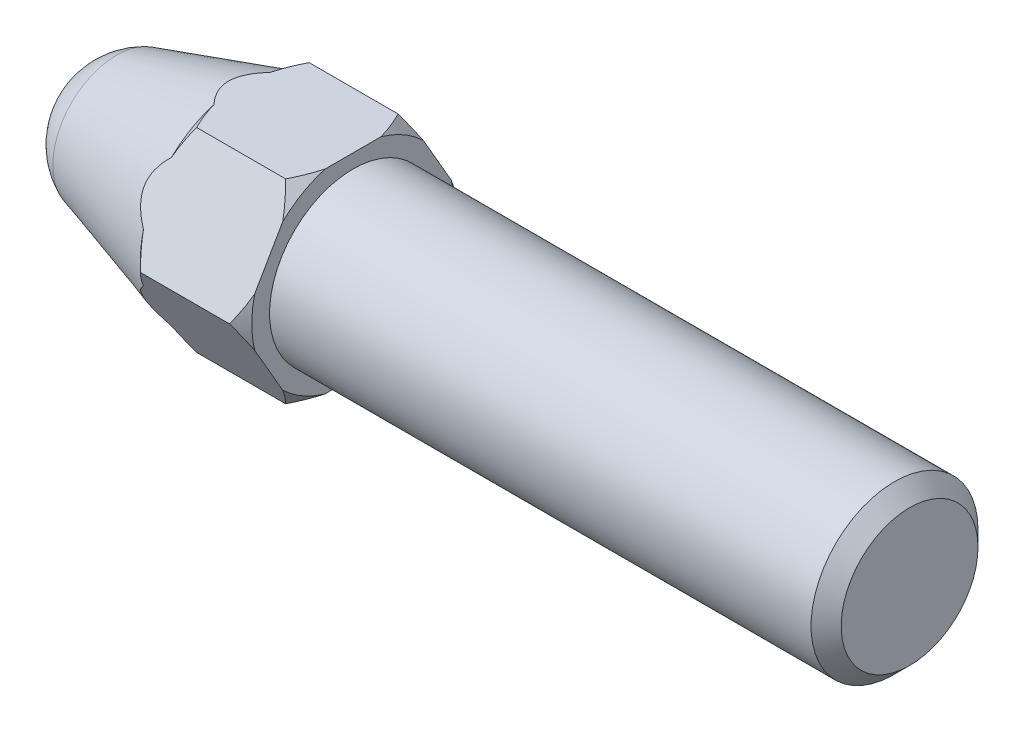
ISO-10303-21;
HEADER;
FILE_DESCRIPTION(('STEP AP214'),'2;1');
FILE_NAME('part.step','',(''),(''),'','','');
FILE_SCHEMA(('AUTOMOTIVE_DESIGN { 1 0 10303 214 1 1 1 1 }'));
ENDSEC;
DATA;
#1=APPLICATION_CONTEXT('core data for automotive mechanical design processes');
#2=APPLICATION_PROTOCOL_DEFINITION('international standard','automotive_design',2000,#1);
#3=PRODUCT_CONTEXT('',#1,'mechanical');
#4=PRODUCT('Part','Part','',(#3));
#5=PRODUCT_RELATED_PRODUCT_CATEGORY('part','',(#4));
#6=PRODUCT_DEFINITION_FORMATION('','',#4);
#7=PRODUCT_DEFINITION_CONTEXT('part definition',#1,'design');
#8=PRODUCT_DEFINITION('design','',#6,#7);
#9=PRODUCT_DEFINITION_SHAPE('','',#8);
#10=(LENGTH_UNIT() NAMED_UNIT(*) SI_UNIT(.MILLI.,.METRE.));
#11=(NAMED_UNIT(*) PLANE_ANGLE_UNIT() SI_UNIT($,.RADIAN.));
#12=(NAMED_UNIT(*) SI_UNIT($,.STERADIAN.) SOLID_ANGLE_UNIT());
#13=UNCERTAINTY_MEASURE_WITH_UNIT(LENGTH_MEASURE(1.E-05),#10,'distance_accuracy_value','');
#14=(GEOMETRIC_REPRESENTATION_CONTEXT(3) GLOBAL_UNCERTAINTY_ASSIGNED_CONTEXT((#13)) GLOBAL_UNIT_ASSIGNED_CONTEXT((#10,
#11,#12)) REPRESENTATION_CONTEXT('',''));
#15=CARTESIAN_POINT('',(0.,0.,0.));
#16=DIRECTION('',(0.,0.,1.));
#17=DIRECTION('',(1.,0.,0.));
#18=AXIS2_PLACEMENT_3D('',#15,#16,#17);
#19=CARTESIAN_POINT('',(-0.4,0.,0.));
#20=DIRECTION('',(-1.,0.,0.));
#21=DIRECTION('',(0.,0.,1.));
#22=AXIS2_PLACEMENT_3D('',#19,#20,#21);
#23=CONICAL_SURFACE('',#22,4.04145,0.785398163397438);
#24=CARTESIAN_POINT('',(1.99999999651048E-06,-0.879587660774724,-3.53361982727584));
#25=CARTESIAN_POINT('',(-0.024278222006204,-0.803403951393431,-3.57760451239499));
#26=CARTESIAN_POINT('',(-0.0512847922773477,-0.727906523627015,-3.62119297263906));
#27=CARTESIAN_POINT('',(-0.109995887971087,-0.578486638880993,-3.70746058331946));
#28=CARTESIAN_POINT('',(-0.141689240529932,-0.504560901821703,-3.75014162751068));
#29=CARTESIAN_POINT('',(-0.209125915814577,-0.358158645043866,-3.83466700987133));
#30=CARTESIAN_POINT('',(-0.244867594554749,-0.285681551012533,-3.87651167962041));
#31=CARTESIAN_POINT('',(-0.319916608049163,-0.141916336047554,-3.95951456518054));
#32=CARTESIAN_POINT('',(-0.359232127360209,-0.0706314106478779,-4.0006709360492));
#33=CARTESIAN_POINT('',(-0.400001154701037,2.00000000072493E-06,-4.04145115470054));
#34=B_SPLINE_CURVE_WITH_KNOTS('',3,(#24,#25,#26,#27,#28,#29,#30,#31,#32,#33),.UNSPECIFIED.,.F.,
.F.,(4,2,2,2,4),(0.,0.273676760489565,0.546711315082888,0.819635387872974,1.09320104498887),.UNSPECIFIED.);
#35=CARTESIAN_POINT('',(0.,-0.87958138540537,-3.53362345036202));
#36=VERTEX_POINT('',#35);
#37=CARTESIAN_POINT('',(-0.4,0.,-4.04145));
#38=VERTEX_POINT('',#37);
#39=EDGE_CURVE('E314',#36,#38,#34,.T.);
#40=ORIENTED_EDGE('',*,*,#39,.T.);
#41=CARTESIAN_POINT('',(-0.400001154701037,-2.E-06,-4.04145115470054));
#42=CARTESIAN_POINT('',(-0.359232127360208,0.070631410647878,-4.0006709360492));
#43=CARTESIAN_POINT('',(-0.319916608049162,0.141916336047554,-3.95951456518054));
#44=CARTESIAN_POINT('',(-0.244867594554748,0.285681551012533,-3.87651167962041));
#45=CARTESIAN_POINT('',(-0.209125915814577,0.358158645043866,-3.83466700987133));
#46=CARTESIAN_POINT('',(-0.141689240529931,0.504560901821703,-3.75014162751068));
#47=CARTESIAN_POINT('',(-0.109995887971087,0.578486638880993,-3.70746058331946));
#48=CARTESIAN_POINT('',(-0.0512847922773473,0.727906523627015,-3.62119297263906));
#49=CARTESIAN_POINT('',(-0.0242782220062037,0.803403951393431,-3.57760451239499));
#50=CARTESIAN_POINT('',(1.99999999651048E-06,0.879587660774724,-3.53361982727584));
#51=B_SPLINE_CURVE_WITH_KNOTS('',3,(#41,#42,#43,#44,#45,#46,#47,#48,#49,#50),.UNSPECIFIED.,.F.,
.F.,(4,2,2,2,4),(0.,0.273565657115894,0.54648972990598,0.819524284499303,1.09320104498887),.UNSPECIFIED.);
#52=CARTESIAN_POINT('',(0.,0.879581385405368,-3.53362345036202));
#53=VERTEX_POINT('',#52);
#54=EDGE_CURVE('E192',#38,#53,#51,.T.);
#55=ORIENTED_EDGE('',*,*,#54,.T.);
#56=CARTESIAN_POINT('',(0.,0.,0.));
#57=DIRECTION('',(1.,0.,0.));
#58=DIRECTION('',(0.,0.,-1.));
#59=AXIS2_PLACEMENT_3D('',#56,#57,#58);
#60=CIRCLE('',#59,3.64145);
#61=EDGE_CURVE('E491',#36,#53,#60,.T.);
#62=ORIENTED_EDGE('',*,*,#61,.F.);
#63=EDGE_LOOP('',(#40,#55,#62));
#64=FACE_BOUND('',#63,.T.);
#65=ADVANCED_FACE('F45',(#64),#23,.T.);
#66=CARTESIAN_POINT('',(-1.88309001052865,-3.49999836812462,4.27440683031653));
#67=CARTESIAN_POINT('',(-1.80337631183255,-3.49999836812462,4.17135627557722));
#68=CARTESIAN_POINT('',(-1.72436090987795,-3.49999836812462,4.06775702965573));
#69=CARTESIAN_POINT('',(-1.56804760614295,-3.49999836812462,3.85923457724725));
#70=CARTESIAN_POINT('',(-1.4907501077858,-3.49999836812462,3.75431106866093));
#71=CARTESIAN_POINT('',(-1.33764370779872,-3.49999836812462,3.54214755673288));
#72=CARTESIAN_POINT('',(-1.26185085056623,-3.49999836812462,3.43489593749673));
#73=CARTESIAN_POINT('',(-1.11284810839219,-3.49999836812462,3.21861917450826));
#74=CARTESIAN_POINT('',(-1.0396380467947,-3.49999836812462,3.10959415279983));
#75=CARTESIAN_POINT('',(-0.891712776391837,-3.49999836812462,2.88227487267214));
#76=CARTESIAN_POINT('',(-0.817211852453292,-3.49999836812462,2.76384047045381));
#77=CARTESIAN_POINT('',(-0.672754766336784,-3.49999836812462,2.52418698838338));
#78=CARTESIAN_POINT('',(-0.602799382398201,-3.49999836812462,2.40296743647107));
#79=CARTESIAN_POINT('',(-0.468917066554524,-3.49999836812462,2.15769718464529));
#80=CARTESIAN_POINT('',(-0.404972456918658,-3.49999836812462,2.03365621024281));
#81=CARTESIAN_POINT('',(-0.284544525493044,-3.49999836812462,1.78203222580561));
#82=CARTESIAN_POINT('',(-0.228057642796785,-3.49999836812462,1.65445094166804));
#83=CARTESIAN_POINT('',(-0.129974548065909,-3.49999836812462,1.40888788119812));
#84=CARTESIAN_POINT('',(-0.0874413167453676,-3.49999836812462,1.29128419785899));
#85=CARTESIAN_POINT('',(-0.0117837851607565,-3.49999836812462,1.05303163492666));
#86=CARTESIAN_POINT('',(0.0213399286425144,-3.49999836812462,0.932382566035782));
#87=CARTESIAN_POINT('',(0.075812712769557,-3.49999836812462,0.690890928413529));
#88=CARTESIAN_POINT('',(0.0973794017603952,-3.49999836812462,0.570098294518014));
#89=CARTESIAN_POINT('',(0.128279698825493,-3.49999836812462,0.326949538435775));
#90=CARTESIAN_POINT('',(0.137615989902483,-3.49999836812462,0.204593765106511));
#91=CARTESIAN_POINT('',(0.143229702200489,-3.49999836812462,-0.03476533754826));
#92=CARTESIAN_POINT('',(0.140089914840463,-3.49999836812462,-0.151755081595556));
#93=CARTESIAN_POINT('',(0.122276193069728,-3.49999836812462,-0.384847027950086));
#94=CARTESIAN_POINT('',(0.10760123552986,-3.49999836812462,-0.500949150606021));
#95=CARTESIAN_POINT('',(0.0673063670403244,-3.49999836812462,-0.733395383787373));
#96=CARTESIAN_POINT('',(0.0414910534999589,-3.49999836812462,-0.849705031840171));
#97=CARTESIAN_POINT('',(-0.0196353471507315,-3.49999836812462,-1.07975342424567));
#98=CARTESIAN_POINT('',(-0.0549459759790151,-3.49999836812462,-1.1934922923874));
#99=CARTESIAN_POINT('',(-0.135370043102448,-3.49999836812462,-1.42357282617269));
#100=CARTESIAN_POINT('',(-0.180873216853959,-3.49999836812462,-1.53977664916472));
#101=CARTESIAN_POINT('',(-0.278913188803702,-3.49999836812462,-1.76918670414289));
#102=CARTESIAN_POINT('',(-0.331452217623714,-3.49999836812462,-1.88239197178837));
#103=CARTESIAN_POINT('',(-0.442327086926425,-3.49999836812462,-2.10635810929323));
#104=CARTESIAN_POINT('',(-0.500681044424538,-3.49999836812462,-2.21710993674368));
#105=CARTESIAN_POINT('',(-0.621900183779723,-3.49999836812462,-2.4360782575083));
#106=CARTESIAN_POINT('',(-0.684764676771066,-3.49999836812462,-2.544295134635));
#107=CARTESIAN_POINT('',(-0.810936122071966,-3.49999836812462,-2.75324162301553));
#108=CARTESIAN_POINT('',(-0.874068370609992,-3.49999836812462,-2.85407728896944));
#109=CARTESIAN_POINT('',(-1.00302727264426,-3.49999836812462,-3.05401596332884));
#110=CARTESIAN_POINT('',(-1.06885412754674,-3.49999836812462,-3.15311884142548));
#111=CARTESIAN_POINT('',(-1.20218806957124,-3.49999836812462,-3.3490236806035));
#112=CARTESIAN_POINT('',(-1.26967748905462,-3.49999836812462,-3.44583770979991));
#113=CARTESIAN_POINT('',(-1.4064709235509,-3.49999836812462,-3.6381365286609));
#114=CARTESIAN_POINT('',(-1.47577443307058,-3.49999836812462,-3.73362167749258));
#115=CARTESIAN_POINT('',(-1.54582069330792,-3.49999836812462,-3.82854915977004));
#116=B_SPLINE_CURVE_WITH_KNOTS('',3,(#66,#67,#68,#69,#70,#71,#72,#73,#74,#75,#76,#77,#78,#79,
#80,#81,#82,#83,#84,#85,#86,#87,#88,#89,#90,#91,#92,#93,#94,#95,#96,#97,#98,#99,#100,#101,#102,
#103,#104,#105,#106,#107,#108,#109,#110,#111,#112,#113,#114,#115),.UNSPECIFIED.,.F.,.F.,(4,2,2,
2,2,2,2,2,2,2,2,2,2,2,2,2,2,2,2,2,2,2,2,2,4),(0.,0.390856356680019,0.781803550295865,
1.17576092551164,1.56969130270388,1.98936472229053,2.40910980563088,2.82757903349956,
3.24584772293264,3.62070247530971,3.99558058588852,4.36312681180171,4.73059239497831,
5.08109916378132,5.43163702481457,5.78859055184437,6.14552685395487,6.51962707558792,
6.89384618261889,7.26927000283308,7.64463660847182,8.00149204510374,8.35837420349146,
8.71239962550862,9.0663274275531),.UNSPECIFIED.);
#117=CARTESIAN_POINT('',(0.,-3.49999836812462,-1.00507190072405));
#118=VERTEX_POINT('',#117);
#119=CARTESIAN_POINT('',(-0.4,-3.49999836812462,-2.020725));
#120=VERTEX_POINT('',#119);
#121=EDGE_CURVE('E351',#118,#120,#116,.T.);
#122=ORIENTED_EDGE('',*,*,#121,.T.);
#123=CARTESIAN_POINT('',(-0.400001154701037,-3.50000036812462,-2.02072384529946));
#124=CARTESIAN_POINT('',(-0.359232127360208,-3.42936695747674,-2.06150406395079));
#125=CARTESIAN_POINT('',(-0.319916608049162,-3.35808203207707,-2.10266043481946));
#126=CARTESIAN_POINT('',(-0.244867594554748,-3.21431681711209,-2.1856633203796));
#127=CARTESIAN_POINT('',(-0.209125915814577,-3.14183972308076,-2.22750799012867));
#128=CARTESIAN_POINT('',(-0.141689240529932,-2.99543746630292,-2.31203337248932));
#129=CARTESIAN_POINT('',(-0.109995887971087,-2.92151172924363,-2.35471441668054));
#130=CARTESIAN_POINT('',(-0.0512847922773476,-2.77209184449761,-2.44098202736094));
#131=CARTESIAN_POINT('',(-0.0242782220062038,-2.69659441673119,-2.48457048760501));
#132=CARTESIAN_POINT('',(1.99999999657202E-06,-2.62041070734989,-2.52855517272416));
#133=B_SPLINE_CURVE_WITH_KNOTS('',3,(#123,#124,#125,#126,#127,#128,#129,#130,#131,#132),
.UNSPECIFIED.,.F.,.F.,(4,2,2,2,4),(0.,0.273565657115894,0.54648972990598,0.819524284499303,
1.09320104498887),.UNSPECIFIED.);
#134=CARTESIAN_POINT('',(0.,-2.62041698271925,-2.52855154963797));
#135=VERTEX_POINT('',#134);
#136=EDGE_CURVE('E308',#120,#135,#133,.T.);
#137=ORIENTED_EDGE('',*,*,#136,.T.);
#138=EDGE_CURVE('E584',#118,#135,#60,.T.);
#139=ORIENTED_EDGE('',*,*,#138,.F.);
#140=EDGE_LOOP('',(#122,#137,#139));
#141=FACE_BOUND('',#140,.T.);
#142=ADVANCED_FACE('F527',(#141),#23,.T.);
#143=CARTESIAN_POINT('',(1.99999999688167E-06,-2.6204107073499,2.52855517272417));
#144=CARTESIAN_POINT('',(-0.0242782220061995,-2.69659441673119,2.48457048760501));
#145=CARTESIAN_POINT('',(-0.0512847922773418,-2.77209184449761,2.44098202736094));
#146=CARTESIAN_POINT('',(-0.109995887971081,-2.92151172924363,2.35471441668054));
#147=CARTESIAN_POINT('',(-0.141689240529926,-2.99543746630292,2.31203337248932));
#148=CARTESIAN_POINT('',(-0.209125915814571,-3.14183972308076,2.22750799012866));
#149=CARTESIAN_POINT('',(-0.244867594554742,-3.21431681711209,2.18566332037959));
#150=CARTESIAN_POINT('',(-0.319916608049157,-3.35808203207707,2.10266043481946));
#151=CARTESIAN_POINT('',(-0.359232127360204,-3.42936695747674,2.06150406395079));
#152=CARTESIAN_POINT('',(-0.400001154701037,-3.50000036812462,2.02072384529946));
#153=B_SPLINE_CURVE_WITH_KNOTS('',3,(#143,#144,#145,#146,#147,#148,#149,#150,#151,#152),
.UNSPECIFIED.,.F.,.F.,(4,2,2,2,4),(0.,0.273676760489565,0.546711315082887,0.819635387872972,
1.09320104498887),.UNSPECIFIED.);
#154=CARTESIAN_POINT('',(0.,-2.62041698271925,2.52855154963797));
#155=VERTEX_POINT('',#154);
#156=CARTESIAN_POINT('',(-0.4,-3.49999836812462,2.020725));
#157=VERTEX_POINT('',#156);
#158=EDGE_CURVE('E383',#155,#157,#153,.T.);
#159=ORIENTED_EDGE('',*,*,#158,.T.);
#160=CARTESIAN_POINT('',(0.,-3.49999836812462,1.00507190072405));
#161=VERTEX_POINT('',#160);
#162=EDGE_CURVE('E343',#157,#161,#116,.T.);
#163=ORIENTED_EDGE('',*,*,#162,.T.);
#164=EDGE_CURVE('E587',#155,#161,#60,.T.);
#165=ORIENTED_EDGE('',*,*,#164,.F.);
#166=EDGE_LOOP('',(#159,#163,#165));
#167=FACE_BOUND('',#166,.T.);
#168=ADVANCED_FACE('F532',(#167),#23,.T.);
#169=CARTESIAN_POINT('',(1.9999999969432E-06,0.879587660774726,3.53361982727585));
#170=CARTESIAN_POINT('',(-0.0242782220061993,0.803403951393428,3.577604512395));
#171=CARTESIAN_POINT('',(-0.0512847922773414,0.72790652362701,3.62119297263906));
#172=CARTESIAN_POINT('',(-0.10999588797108,0.578486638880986,3.70746058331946));
#173=CARTESIAN_POINT('',(-0.141689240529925,0.504560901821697,3.75014162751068));
#174=CARTESIAN_POINT('',(-0.20912591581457,0.35815864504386,3.83466700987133));
#175=CARTESIAN_POINT('',(-0.244867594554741,0.285681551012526,3.87651167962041));
#176=CARTESIAN_POINT('',(-0.319916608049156,0.141916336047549,3.95951456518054));
#177=CARTESIAN_POINT('',(-0.359232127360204,0.0706314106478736,4.00067093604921));
#178=CARTESIAN_POINT('',(-0.400001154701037,-2.00000000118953E-06,4.04145115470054));
#179=B_SPLINE_CURVE_WITH_KNOTS('',3,(#169,#170,#171,#172,#173,#174,#175,#176,#177,#178),
.UNSPECIFIED.,.F.,.F.,(4,2,2,2,4),(0.,0.273676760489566,0.546711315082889,0.819635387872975,
1.09320104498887),.UNSPECIFIED.);
#180=CARTESIAN_POINT('',(0.,0.879581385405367,3.53362345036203));
#181=VERTEX_POINT('',#180);
#182=CARTESIAN_POINT('',(-0.4,0.,4.04145));
#183=VERTEX_POINT('',#182);
#184=EDGE_CURVE('E446',#181,#183,#179,.T.);
#185=ORIENTED_EDGE('',*,*,#184,.T.);
#186=CARTESIAN_POINT('',(-0.400001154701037,2.00000000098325E-06,4.04145115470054));
#187=CARTESIAN_POINT('',(-0.359232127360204,-0.0706314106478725,4.00067093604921));
#188=CARTESIAN_POINT('',(-0.319916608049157,-0.141916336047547,3.95951456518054));
#189=CARTESIAN_POINT('',(-0.244867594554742,-0.285681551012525,3.87651167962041));
#190=CARTESIAN_POINT('',(-0.20912591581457,-0.358158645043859,3.83466700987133));
#191=CARTESIAN_POINT('',(-0.141689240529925,-0.504560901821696,3.75014162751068));
#192=CARTESIAN_POINT('',(-0.10999588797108,-0.578486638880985,3.70746058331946));
#193=CARTESIAN_POINT('',(-0.0512847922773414,-0.727906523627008,3.62119297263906));
#194=CARTESIAN_POINT('',(-0.0242782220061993,-0.803403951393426,3.577604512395));
#195=CARTESIAN_POINT('',(1.9999999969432E-06,-0.879587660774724,3.53361982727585));
#196=B_SPLINE_CURVE_WITH_KNOTS('',3,(#186,#187,#188,#189,#190,#191,#192,#193,#194,#195),
.UNSPECIFIED.,.F.,.F.,(4,2,2,2,4),(0.,0.273565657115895,0.546489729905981,0.819524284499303,
1.09320104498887),.UNSPECIFIED.);
#197=CARTESIAN_POINT('',(0.,-0.879581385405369,3.53362345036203));
#198=VERTEX_POINT('',#197);
#199=EDGE_CURVE('E390',#183,#198,#196,.T.);
#200=ORIENTED_EDGE('',*,*,#199,.T.);
#201=EDGE_CURVE('E590',#181,#198,#60,.T.);
#202=ORIENTED_EDGE('',*,*,#201,.F.);
#203=EDGE_LOOP('',(#185,#200,#202));
#204=FACE_BOUND('',#203,.T.);
#205=ADVANCED_FACE('F541',(#204),#23,.T.);
#206=CARTESIAN_POINT('',(0.,2.62041698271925,-2.52855154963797));
#207=VERTEX_POINT('',#206);
#208=CARTESIAN_POINT('',(0.,3.49999836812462,-1.00507190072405));
#209=VERTEX_POINT('',#208);
#210=EDGE_CURVE('E190',#207,#209,#60,.T.);
#211=ORIENTED_EDGE('',*,*,#210,.F.);
#212=CARTESIAN_POINT('',(1.99999999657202E-06,2.62041070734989,-2.52855517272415));
#213=CARTESIAN_POINT('',(-0.0242782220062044,2.69659441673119,-2.484570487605));
#214=CARTESIAN_POINT('',(-0.0512847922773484,2.77209184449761,-2.44098202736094));
#215=CARTESIAN_POINT('',(-0.109995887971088,2.92151172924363,-2.35471441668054));
#216=CARTESIAN_POINT('',(-0.141689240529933,2.99543746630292,-2.31203337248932));
#217=CARTESIAN_POINT('',(-0.209125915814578,3.14183972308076,-2.22750799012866));
#218=CARTESIAN_POINT('',(-0.24486759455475,3.21431681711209,-2.18566332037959));
#219=CARTESIAN_POINT('',(-0.319916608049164,3.35808203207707,-2.10266043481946));
#220=CARTESIAN_POINT('',(-0.35923212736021,3.42936695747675,-2.06150406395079));
#221=CARTESIAN_POINT('',(-0.400001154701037,3.50000036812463,-2.02072384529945));
#222=B_SPLINE_CURVE_WITH_KNOTS('',3,(#212,#213,#214,#215,#216,#217,#218,#219,#220,#221),
.UNSPECIFIED.,.F.,.F.,(4,2,2,2,4),(0.,0.273676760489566,0.546711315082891,0.819635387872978,
1.09320104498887),.UNSPECIFIED.);
#223=CARTESIAN_POINT('',(-0.4,3.49999836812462,-2.020725));
#224=VERTEX_POINT('',#223);
#225=EDGE_CURVE('E180',#207,#224,#222,.T.);
#226=ORIENTED_EDGE('',*,*,#225,.T.);
#227=CARTESIAN_POINT('',(-1.88309001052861,3.49999836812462,4.27440683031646));
#228=CARTESIAN_POINT('',(-1.8033763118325,3.49999836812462,4.17135627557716));
#229=CARTESIAN_POINT('',(-1.7243609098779,3.49999836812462,4.06775702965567));
#230=CARTESIAN_POINT('',(-1.5680476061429,3.49999836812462,3.85923457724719));
#231=CARTESIAN_POINT('',(-1.49075010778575,3.49999836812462,3.75431106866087));
#232=CARTESIAN_POINT('',(-1.33764370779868,3.49999836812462,3.54214755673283));
#233=CARTESIAN_POINT('',(-1.26185085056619,3.49999836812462,3.43489593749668));
#234=CARTESIAN_POINT('',(-1.11284810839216,3.49999836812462,3.21861917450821));
#235=CARTESIAN_POINT('',(-1.03963804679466,3.49999836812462,3.10959415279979));
#236=CARTESIAN_POINT('',(-0.891712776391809,3.49999836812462,2.8822748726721));
#237=CARTESIAN_POINT('',(-0.817211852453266,3.49999836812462,2.76384047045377));
#238=CARTESIAN_POINT('',(-0.672754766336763,3.49999836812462,2.52418698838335));
#239=CARTESIAN_POINT('',(-0.602799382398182,3.49999836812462,2.40296743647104));
#240=CARTESIAN_POINT('',(-0.468917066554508,3.49999836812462,2.15769718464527));
#241=CARTESIAN_POINT('',(-0.404972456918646,3.49999836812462,2.03365621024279));
#242=CARTESIAN_POINT('',(-0.284544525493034,3.49999836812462,1.78203222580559));
#243=CARTESIAN_POINT('',(-0.228057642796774,3.49999836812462,1.65445094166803));
#244=CARTESIAN_POINT('',(-0.1299745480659,3.49999836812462,1.40888788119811));
#245=CARTESIAN_POINT('',(-0.0874413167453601,3.49999836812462,1.29128419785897));
#246=CARTESIAN_POINT('',(-0.0117837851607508,3.49999836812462,1.05303163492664));
#247=CARTESIAN_POINT('',(0.0213399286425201,3.49999836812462,0.93238256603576));
#248=CARTESIAN_POINT('',(0.0758127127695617,3.49999836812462,0.690890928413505));
#249=CARTESIAN_POINT('',(0.097379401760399,3.49999836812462,0.570098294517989));
#250=CARTESIAN_POINT('',(0.128279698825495,3.49999836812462,0.326949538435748));
#251=CARTESIAN_POINT('',(0.137615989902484,3.49999836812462,0.204593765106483));
#252=CARTESIAN_POINT('',(0.143229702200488,3.49999836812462,-0.0347653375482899));
#253=CARTESIAN_POINT('',(0.14008991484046,3.49999836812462,-0.151755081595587));
#254=CARTESIAN_POINT('',(0.122276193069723,3.49999836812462,-0.384847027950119));
#255=CARTESIAN_POINT('',(0.107601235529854,3.49999836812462,-0.500949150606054));
#256=CARTESIAN_POINT('',(0.067306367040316,3.49999836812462,-0.733395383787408));
#257=CARTESIAN_POINT('',(0.0414910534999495,3.49999836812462,-0.849705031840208));
#258=CARTESIAN_POINT('',(-0.0196353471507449,3.49999836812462,-1.07975342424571));
#259=CARTESIAN_POINT('',(-0.0549459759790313,3.49999836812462,-1.19349229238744));
#260=CARTESIAN_POINT('',(-0.135370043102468,3.49999836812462,-1.42357282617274));
#261=CARTESIAN_POINT('',(-0.180873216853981,3.49999836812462,-1.53977664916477));
#262=CARTESIAN_POINT('',(-0.278913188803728,3.49999836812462,-1.76918670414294));
#263=CARTESIAN_POINT('',(-0.331452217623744,3.49999836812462,-1.88239197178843));
#264=CARTESIAN_POINT('',(-0.442327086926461,3.49999836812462,-2.1063581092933));
#265=CARTESIAN_POINT('',(-0.500681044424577,3.49999836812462,-2.21710993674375));
#266=CARTESIAN_POINT('',(-0.621900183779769,3.49999836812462,-2.43607825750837));
#267=CARTESIAN_POINT('',(-0.684764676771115,3.49999836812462,-2.54429513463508));
#268=CARTESIAN_POINT('',(-0.810936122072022,3.49999836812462,-2.75324162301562));
#269=CARTESIAN_POINT('',(-0.87406837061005,3.49999836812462,-2.85407728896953));
#270=CARTESIAN_POINT('',(-1.00302727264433,3.49999836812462,-3.05401596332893));
#271=CARTESIAN_POINT('',(-1.0688541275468,3.49999836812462,-3.15311884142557));
#272=CARTESIAN_POINT('',(-1.20218806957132,3.49999836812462,-3.3490236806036));
#273=CARTESIAN_POINT('',(-1.2696774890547,3.49999836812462,-3.44583770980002));
#274=CARTESIAN_POINT('',(-1.40647092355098,3.49999836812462,-3.63813652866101));
#275=CARTESIAN_POINT('',(-1.47577443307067,3.49999836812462,-3.7336216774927));
#276=CARTESIAN_POINT('',(-1.545820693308,3.49999836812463,-3.82854915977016));
#277=B_SPLINE_CURVE_WITH_KNOTS('',3,(#227,#228,#229,#230,#231,#232,#233,#234,#235,#236,#237,
#238,#239,#240,#241,#242,#243,#244,#245,#246,#247,#248,#249,#250,#251,#252,#253,#254,#255,#256,
#257,#258,#259,#260,#261,#262,#263,#264,#265,#266,#267,#268,#269,#270,#271,#272,#273,#274,#275,
#276),.UNSPECIFIED.,.F.,.F.,(4,2,2,2,2,2,2,2,2,2,2,2,2,2,2,2,2,2,2,2,2,2,2,2,4),(0.,
0.390856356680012,0.78180355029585,1.17576092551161,1.56969130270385,1.98936472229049,
2.40910980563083,2.82757903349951,3.24584772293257,3.62070247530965,3.99558058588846,
4.36312681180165,4.73059239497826,5.08109916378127,5.43163702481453,5.78859055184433,
6.14552685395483,6.51962707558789,6.89384618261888,7.26927000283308,7.64463660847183,
8.00149204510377,8.3583742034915,8.71239962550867,9.06632742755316),.UNSPECIFIED.);
#278=EDGE_CURVE('E168',#224,#209,#277,.F.);
#279=ORIENTED_EDGE('',*,*,#278,.T.);
#280=EDGE_LOOP('',(#211,#226,#279));
#281=FACE_BOUND('',#280,.T.);
#282=ADVANCED_FACE('F189',(#281),#23,.T.);
#283=CARTESIAN_POINT('',(0.,3.49999836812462,1.00507190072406));
#284=VERTEX_POINT('',#283);
#285=CARTESIAN_POINT('',(-0.4,3.49999836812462,2.020725));
#286=VERTEX_POINT('',#285);
#287=EDGE_CURVE('E67',#284,#286,#277,.F.);
#288=ORIENTED_EDGE('',*,*,#287,.T.);
#289=CARTESIAN_POINT('',(-0.400001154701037,3.50000036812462,2.02072384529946));
#290=CARTESIAN_POINT('',(-0.359232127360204,3.42936695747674,2.0615040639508));
#291=CARTESIAN_POINT('',(-0.319916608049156,3.35808203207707,2.10266043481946));
#292=CARTESIAN_POINT('',(-0.244867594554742,3.21431681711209,2.18566332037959));
#293=CARTESIAN_POINT('',(-0.20912591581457,3.14183972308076,2.22750799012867));
#294=CARTESIAN_POINT('',(-0.141689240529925,2.99543746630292,2.31203337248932));
#295=CARTESIAN_POINT('',(-0.10999588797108,2.92151172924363,2.35471441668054));
#296=CARTESIAN_POINT('',(-0.0512847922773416,2.77209184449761,2.44098202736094));
#297=CARTESIAN_POINT('',(-0.0242782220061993,2.69659441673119,2.48457048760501));
#298=CARTESIAN_POINT('',(1.99999999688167E-06,2.62041070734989,2.52855517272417));
#299=B_SPLINE_CURVE_WITH_KNOTS('',3,(#289,#290,#291,#292,#293,#294,#295,#296,#297,#298),
.UNSPECIFIED.,.F.,.F.,(4,2,2,2,4),(0.,0.273565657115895,0.546489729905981,0.819524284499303,
1.09320104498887),.UNSPECIFIED.);
#300=CARTESIAN_POINT('',(0.,2.62041698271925,2.52855154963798));
#301=VERTEX_POINT('',#300);
#302=EDGE_CURVE('E439',#286,#301,#299,.T.);
#303=ORIENTED_EDGE('',*,*,#302,.T.);
#304=EDGE_CURVE('E544',#284,#301,#60,.T.);
#305=ORIENTED_EDGE('',*,*,#304,.F.);
#306=EDGE_LOOP('',(#288,#303,#305));
#307=FACE_BOUND('',#306,.T.);
#308=ADVANCED_FACE('F528',(#307),#23,.T.);
#309=CARTESIAN_POINT('',(0.,3.64145,0.));
#310=DIRECTION('',(-1.,0.,0.));
#311=DIRECTION('',(0.,0.,1.));
#312=AXIS2_PLACEMENT_3D('',#309,#310,#311);
#313=PLANE('',#312);
#314=CARTESIAN_POINT('',(0.,0.,0.));
#315=DIRECTION('',(1.,0.,0.));
#316=DIRECTION('',(0.,0.,-1.));
#317=AXIS2_PLACEMENT_3D('',#314,#315,#316);
#318=CIRCLE('',#317,3.);
#319=CARTESIAN_POINT('',(0.,0.,-3.));
#320=VERTEX_POINT('',#319);
#321=EDGE_CURVE('E187',#320,#320,#318,.T.);
#322=ORIENTED_EDGE('',*,*,#321,.F.);
#323=EDGE_LOOP('',(#322));
#324=FACE_BOUND('',#323,.T.);
#325=ORIENTED_EDGE('',*,*,#61,.T.);
#326=DIRECTION('',(0.,0.866025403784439,0.5));
#327=VECTOR('',#326,1.);
#328=CARTESIAN_POINT('',(0.,4.48108668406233,-1.45429339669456));
#329=LINE('',#328,#327);
#330=EDGE_CURVE('E512',#53,#207,#329,.T.);
#331=ORIENTED_EDGE('',*,*,#330,.T.);
#332=ORIENTED_EDGE('',*,*,#210,.T.);
#333=DIRECTION('',(0.,0.,1.));
#334=VECTOR('',#333,1.);
#335=CARTESIAN_POINT('',(0.,3.49999836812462,0.));
#336=LINE('',#335,#334);
#337=EDGE_CURVE('E170',#209,#284,#336,.T.);
#338=ORIENTED_EDGE('',*,*,#337,.T.);
#339=ORIENTED_EDGE('',*,*,#304,.T.);
#340=DIRECTION('',(0.,-0.866025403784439,0.5));
#341=VECTOR('',#340,1.);
#342=CARTESIAN_POINT('',(0.,4.48108668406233,1.45429339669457));
#343=LINE('',#342,#341);
#344=EDGE_CURVE('E496',#301,#181,#343,.T.);
#345=ORIENTED_EDGE('',*,*,#344,.T.);
#346=ORIENTED_EDGE('',*,*,#201,.T.);
#347=DIRECTION('',(0.,-0.866025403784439,-0.5));
#348=VECTOR('',#347,1.);
#349=CARTESIAN_POINT('',(0.,0.981088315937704,4.60788160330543));
#350=LINE('',#349,#348);
#351=EDGE_CURVE('E500',#198,#155,#350,.T.);
#352=ORIENTED_EDGE('',*,*,#351,.T.);
#353=ORIENTED_EDGE('',*,*,#164,.T.);
#354=DIRECTION('',(0.,0.,-1.));
#355=VECTOR('',#354,1.);
#356=CARTESIAN_POINT('',(0.,-3.49999836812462,0.));
#357=LINE('',#356,#355);
#358=EDGE_CURVE('E504',#161,#118,#357,.T.);
#359=ORIENTED_EDGE('',*,*,#358,.T.);
#360=ORIENTED_EDGE('',*,*,#138,.T.);
#361=DIRECTION('',(0.,0.866025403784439,-0.5));
#362=VECTOR('',#361,1.);
#363=CARTESIAN_POINT('',(0.,0.981088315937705,-4.60788160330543));
#364=LINE('',#363,#362);
#365=EDGE_CURVE('E508',#135,#36,#364,.T.);
#366=ORIENTED_EDGE('',*,*,#365,.T.);
#367=EDGE_LOOP('',(#325,#331,#332,#338,#339,#345,#346,#352,#353,#359,#360,#366));
#368=FACE_BOUND('',#367,.T.);
#369=ADVANCED_FACE('F227',(#324,#368),#313,.F.);
#370=CARTESIAN_POINT('',(-10.,3.49999836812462,-2.020725));
#371=DIRECTION('',(0.,-0.5,0.866025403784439));
#372=DIRECTION('',(0.,0.866025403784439,0.5));
#373=AXIS2_PLACEMENT_3D('',#370,#371,#372);
#374=PLANE('',#373);
#375=CARTESIAN_POINT('',(-3.59999884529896,3.50000036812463,-2.02072384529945));
#376=CARTESIAN_POINT('',(-3.64076787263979,3.42936695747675,-2.06150406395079));
#377=CARTESIAN_POINT('',(-3.68008339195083,3.35808203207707,-2.10266043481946));
#378=CARTESIAN_POINT('',(-3.75513240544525,3.21431681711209,-2.1856633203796));
#379=CARTESIAN_POINT('',(-3.79087408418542,3.14183972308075,-2.22750799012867));
#380=CARTESIAN_POINT('',(-3.85831075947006,2.99543746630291,-2.31203337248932));
#381=CARTESIAN_POINT('',(-3.89000411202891,2.92151172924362,-2.35471441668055));
#382=CARTESIAN_POINT('',(-3.94871520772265,2.7720918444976,-2.44098202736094));
#383=CARTESIAN_POINT('',(-3.9757217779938,2.69659441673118,-2.48457048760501));
#384=CARTESIAN_POINT('',(-4.000002,2.62041070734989,-2.52855517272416));
#385=B_SPLINE_CURVE_WITH_KNOTS('',3,(#375,#376,#377,#378,#379,#380,#381,#382,#383,#384),
.UNSPECIFIED.,.F.,.F.,(4,2,2,2,4),(0.,0.273565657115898,0.546489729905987,0.819524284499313,
1.09320104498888),.UNSPECIFIED.);
#386=CARTESIAN_POINT('',(-3.6,3.49999836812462,-2.020725));
#387=VERTEX_POINT('',#386);
#388=CARTESIAN_POINT('',(-4.,2.62041698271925,-2.52855154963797));
#389=VERTEX_POINT('',#388);
#390=EDGE_CURVE('E183',#387,#389,#385,.T.);
#391=ORIENTED_EDGE('',*,*,#390,.F.);
#392=DIRECTION('',(1.,0.,0.));
#393=VECTOR('',#392,1.);
#394=CARTESIAN_POINT('',(-10.,3.49999836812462,-2.020725));
#395=LINE('',#394,#393);
#396=EDGE_CURVE('E60',#387,#224,#395,.T.);
#397=ORIENTED_EDGE('',*,*,#396,.T.);
#398=ORIENTED_EDGE('',*,*,#225,.F.);
#399=ORIENTED_EDGE('',*,*,#330,.F.);
#400=ORIENTED_EDGE('',*,*,#54,.F.);
#401=DIRECTION('',(1.,0.,0.));
#402=VECTOR('',#401,1.);
#403=CARTESIAN_POINT('',(-10.,0.,-4.04145));
#404=LINE('',#403,#402);
#405=CARTESIAN_POINT('',(-3.6,0.,-4.04145));
#406=VERTEX_POINT('',#405);
#407=EDGE_CURVE('E545',#406,#38,#404,.T.);
#408=ORIENTED_EDGE('',*,*,#407,.F.);
#409=CARTESIAN_POINT('',(-4.000002,0.879587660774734,-3.53361982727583));
#410=CARTESIAN_POINT('',(-3.9757217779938,0.803403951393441,-3.57760451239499));
#411=CARTESIAN_POINT('',(-3.94871520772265,0.727906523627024,-3.62119297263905));
#412=CARTESIAN_POINT('',(-3.89000411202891,0.578486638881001,-3.70746058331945));
#413=CARTESIAN_POINT('',(-3.85831075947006,0.50456090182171,-3.75014162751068));
#414=CARTESIAN_POINT('',(-3.79087408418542,0.358158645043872,-3.83466700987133));
#415=CARTESIAN_POINT('',(-3.75513240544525,0.285681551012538,-3.8765116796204));
#416=CARTESIAN_POINT('',(-3.68008339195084,0.141916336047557,-3.95951456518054));
#417=CARTESIAN_POINT('',(-3.64076787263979,0.070631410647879,-4.0006709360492));
#418=CARTESIAN_POINT('',(-3.59999884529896,-2.00000000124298E-06,-4.04145115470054));
#419=B_SPLINE_CURVE_WITH_KNOTS('',3,(#409,#410,#411,#412,#413,#414,#415,#416,#417,#418),
.UNSPECIFIED.,.F.,.F.,(4,2,2,2,4),(0.,0.273676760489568,0.546711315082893,0.819635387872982,
1.09320104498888),.UNSPECIFIED.);
#420=CARTESIAN_POINT('',(-4.,0.879581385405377,-3.53362345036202));
#421=VERTEX_POINT('',#420);
#422=EDGE_CURVE('E201',#421,#406,#419,.T.);
#423=ORIENTED_EDGE('',*,*,#422,.F.);
#424=CARTESIAN_POINT('',(-3.999998,2.62041886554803,-2.52855046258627));
#425=CARTESIAN_POINT('',(-4.05423261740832,2.56922767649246,-2.55810570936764));
#426=CARTESIAN_POINT('',(-4.10640940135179,2.51605977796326,-2.58880220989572));
#427=CARTESIAN_POINT('',(-4.20483835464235,2.40410641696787,-2.6534385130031));
#428=CARTESIAN_POINT('',(-4.25095039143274,2.34522953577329,-2.68743109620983));
#429=CARTESIAN_POINT('',(-4.33335398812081,2.22172039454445,-2.75873913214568));
#430=CARTESIAN_POINT('',(-4.36956535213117,2.15704646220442,-2.79607864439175));
#431=CARTESIAN_POINT('',(-4.42688879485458,2.02324680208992,-2.87332791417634));
#432=CARTESIAN_POINT('',(-4.44812814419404,1.9541641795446,-2.9132127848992));
#433=CARTESIAN_POINT('',(-4.4689322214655,1.83177601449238,-2.98387362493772));
#434=CARTESIAN_POINT('',(-4.47267757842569,1.77900276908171,-3.01434227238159));
#435=CARTESIAN_POINT('',(-4.46950918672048,1.6736721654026,-3.07515492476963));
#436=CARTESIAN_POINT('',(-4.4625907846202,1.62111491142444,-3.10549886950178));
#437=CARTESIAN_POINT('',(-4.43902860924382,1.51811063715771,-3.16496841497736));
#438=CARTESIAN_POINT('',(-4.42245533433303,1.46765113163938,-3.19410122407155));
#439=CARTESIAN_POINT('',(-4.38123050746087,1.36911415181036,-3.25099157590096));
#440=CARTESIAN_POINT('',(-4.35654646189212,1.32104716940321,-3.27874306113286));
#441=CARTESIAN_POINT('',(-4.2853047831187,1.20160539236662,-3.34770280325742));
#442=CARTESIAN_POINT('',(-4.23424029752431,1.132259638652,-3.38773959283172));
#443=CARTESIAN_POINT('',(-4.15065927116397,1.03357515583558,-3.44471510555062));
#444=CARTESIAN_POINT('',(-4.12183279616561,1.00174877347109,-3.46309007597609));
#445=CARTESIAN_POINT('',(-4.06226567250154,0.939603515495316,-3.49896965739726));
#446=CARTESIAN_POINT('',(-4.03153016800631,0.90928095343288,-3.51647639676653));
#447=CARTESIAN_POINT('',(-3.999998,0.879579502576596,-3.53362453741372));
#448=B_SPLINE_CURVE_WITH_KNOTS('',3,(#424,#425,#426,#427,#428,#429,#430,#431,#432,#433,#434,
#435,#436,#437,#438,#439,#440,#441,#442,#443,#444,#445,#446,#447),.UNSPECIFIED.,.F.,.F.,(4,2,2,
2,2,2,2,2,2,2,2,4),(0.,0.241052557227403,0.48694930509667,0.734782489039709,0.980482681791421,
1.16273825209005,1.3450733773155,1.52609351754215,1.70784789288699,1.99143000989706,
2.13151119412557,2.27123003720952),.UNSPECIFIED.);
#449=EDGE_CURVE('E239',#389,#421,#448,.T.);
#450=ORIENTED_EDGE('',*,*,#449,.F.);
#451=EDGE_LOOP('',(#391,#397,#398,#399,#400,#408,#423,#450));
#452=FACE_BOUND('',#451,.T.);
#453=ADVANCED_FACE('F179',(#452),#374,.F.);
#454=CARTESIAN_POINT('',(-10.,0.,-4.04145));
#455=DIRECTION('',(0.,0.5,0.866025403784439));
#456=DIRECTION('',(0.,0.866025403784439,-0.5));
#457=AXIS2_PLACEMENT_3D('',#454,#455,#456);
#458=PLANE('',#457);
#459=CARTESIAN_POINT('',(-3.59999884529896,2.E-06,-4.04145115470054));
#460=CARTESIAN_POINT('',(-3.64076787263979,-0.0706314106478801,-4.0006709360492));
#461=CARTESIAN_POINT('',(-3.68008339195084,-0.141916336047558,-3.95951456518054));
#462=CARTESIAN_POINT('',(-3.75513240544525,-0.285681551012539,-3.8765116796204));
#463=CARTESIAN_POINT('',(-3.79087408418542,-0.358158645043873,-3.83466700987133));
#464=CARTESIAN_POINT('',(-3.85831075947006,-0.504560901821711,-3.75014162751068));
#465=CARTESIAN_POINT('',(-3.89000411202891,-0.578486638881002,-3.70746058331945));
#466=CARTESIAN_POINT('',(-3.94871520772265,-0.727906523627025,-3.62119297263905));
#467=CARTESIAN_POINT('',(-3.9757217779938,-0.803403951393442,-3.57760451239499));
#468=CARTESIAN_POINT('',(-4.000002,-0.879587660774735,-3.53361982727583));
#469=B_SPLINE_CURVE_WITH_KNOTS('',3,(#459,#460,#461,#462,#463,#464,#465,#466,#467,#468),
.UNSPECIFIED.,.F.,.F.,(4,2,2,2,4),(0.,0.273565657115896,0.546489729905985,0.819524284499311,
1.09320104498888),.UNSPECIFIED.);
#470=CARTESIAN_POINT('',(-4.,-0.879581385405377,-3.53362345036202));
#471=VERTEX_POINT('',#470);
#472=EDGE_CURVE('E193',#406,#471,#469,.T.);
#473=ORIENTED_EDGE('',*,*,#472,.F.);
#474=ORIENTED_EDGE('',*,*,#407,.T.);
#475=ORIENTED_EDGE('',*,*,#39,.F.);
#476=ORIENTED_EDGE('',*,*,#365,.F.);
#477=ORIENTED_EDGE('',*,*,#136,.F.);
#478=DIRECTION('',(1.,0.,0.));
#479=VECTOR('',#478,1.);
#480=CARTESIAN_POINT('',(-10.,-3.49999836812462,-2.020725));
#481=LINE('',#480,#479);
#482=CARTESIAN_POINT('',(-3.6,-3.49999836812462,-2.020725));
#483=VERTEX_POINT('',#482);
#484=EDGE_CURVE('E550',#483,#120,#481,.T.);
#485=ORIENTED_EDGE('',*,*,#484,.F.);
#486=CARTESIAN_POINT('',(-4.000002,-2.62041070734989,-2.52855517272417));
#487=CARTESIAN_POINT('',(-3.97572177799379,-2.69659441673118,-2.48457048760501));
#488=CARTESIAN_POINT('',(-3.94871520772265,-2.7720918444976,-2.44098202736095));
#489=CARTESIAN_POINT('',(-3.89000411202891,-2.92151172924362,-2.35471441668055));
#490=CARTESIAN_POINT('',(-3.85831075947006,-2.99543746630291,-2.31203337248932));
#491=CARTESIAN_POINT('',(-3.79087408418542,-3.14183972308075,-2.22750799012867));
#492=CARTESIAN_POINT('',(-3.75513240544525,-3.21431681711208,-2.1856633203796));
#493=CARTESIAN_POINT('',(-3.68008339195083,-3.35808203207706,-2.10266043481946));
#494=CARTESIAN_POINT('',(-3.64076787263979,-3.42936695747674,-2.0615040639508));
#495=CARTESIAN_POINT('',(-3.59999884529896,-3.50000036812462,-2.02072384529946));
#496=B_SPLINE_CURVE_WITH_KNOTS('',3,(#486,#487,#488,#489,#490,#491,#492,#493,#494,#495),
.UNSPECIFIED.,.F.,.F.,(4,2,2,2,4),(0.,0.273676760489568,0.546711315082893,0.819635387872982,
1.09320104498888),.UNSPECIFIED.);
#497=CARTESIAN_POINT('',(-4.,-2.62041698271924,-2.52855154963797));
#498=VERTEX_POINT('',#497);
#499=EDGE_CURVE('E301',#498,#483,#496,.T.);
#500=ORIENTED_EDGE('',*,*,#499,.F.);
#501=CARTESIAN_POINT('',(-3.999998,-0.879579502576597,-3.53362453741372));
#502=CARTESIAN_POINT('',(-4.05423261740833,-0.930770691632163,-3.50406929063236));
#503=CARTESIAN_POINT('',(-4.1064094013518,-0.983938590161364,-3.47337279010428));
#504=CARTESIAN_POINT('',(-4.20483835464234,-1.09589195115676,-3.4087364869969));
#505=CARTESIAN_POINT('',(-4.25095039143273,-1.15476883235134,-3.37474390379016));
#506=CARTESIAN_POINT('',(-4.3333539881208,-1.27827797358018,-3.30343586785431));
#507=CARTESIAN_POINT('',(-4.36956535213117,-1.34295190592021,-3.26609635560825));
#508=CARTESIAN_POINT('',(-4.42688879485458,-1.4767515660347,-3.18884708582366));
#509=CARTESIAN_POINT('',(-4.44812814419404,-1.54583418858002,-3.14896221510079));
#510=CARTESIAN_POINT('',(-4.4689322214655,-1.66822235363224,-3.07830137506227));
#511=CARTESIAN_POINT('',(-4.47267757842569,-1.72099559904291,-3.04783272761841));
#512=CARTESIAN_POINT('',(-4.46950918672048,-1.82632620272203,-2.98702007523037));
#513=CARTESIAN_POINT('',(-4.4625907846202,-1.87888345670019,-2.95667613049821));
#514=CARTESIAN_POINT('',(-4.43902860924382,-1.98188773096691,-2.89720658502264));
#515=CARTESIAN_POINT('',(-4.42245533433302,-2.03234723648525,-2.86807377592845));
#516=CARTESIAN_POINT('',(-4.38123050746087,-2.13088421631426,-2.81118342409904));
#517=CARTESIAN_POINT('',(-4.35654646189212,-2.17895119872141,-2.78343193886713));
#518=CARTESIAN_POINT('',(-4.28530478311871,-2.29839297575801,-2.71447219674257));
#519=CARTESIAN_POINT('',(-4.23424029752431,-2.36773872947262,-2.67443540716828));
#520=CARTESIAN_POINT('',(-4.15065927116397,-2.46642321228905,-2.61745989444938));
#521=CARTESIAN_POINT('',(-4.12183279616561,-2.49824959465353,-2.59908492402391));
#522=CARTESIAN_POINT('',(-4.06226567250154,-2.56039485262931,-2.56320534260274));
#523=CARTESIAN_POINT('',(-4.03153016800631,-2.59071741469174,-2.54569860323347));
#524=CARTESIAN_POINT('',(-3.999998,-2.62041886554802,-2.52855046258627));
#525=B_SPLINE_CURVE_WITH_KNOTS('',3,(#501,#502,#503,#504,#505,#506,#507,#508,#509,#510,#511,
#512,#513,#514,#515,#516,#517,#518,#519,#520,#521,#522,#523,#524),.UNSPECIFIED.,.F.,.F.,(4,2,2,
2,2,2,2,2,2,2,2,4),(0.,0.2410525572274,0.486949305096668,0.734782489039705,0.980482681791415,
1.16273825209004,1.3450733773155,1.52609351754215,1.70784789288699,1.99143000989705,
2.13151119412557,2.27123003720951),.UNSPECIFIED.);
#526=EDGE_CURVE('E205',#471,#498,#525,.T.);
#527=ORIENTED_EDGE('',*,*,#526,.F.);
#528=EDGE_LOOP('',(#473,#474,#475,#476,#477,#485,#500,#527));
#529=FACE_BOUND('',#528,.T.);
#530=ADVANCED_FACE('F226',(#529),#458,.F.);
#531=CARTESIAN_POINT('',(-10.,-3.49999836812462,-2.020725));
#532=DIRECTION('',(0.,1.,0.));
#533=DIRECTION('',(0.,0.,-1.));
#534=AXIS2_PLACEMENT_3D('',#531,#532,#533);
#535=PLANE('',#534);
#536=CARTESIAN_POINT('',(-2.11690998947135,-3.49999836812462,4.27440683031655));
#537=CARTESIAN_POINT('',(-2.19662368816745,-3.49999836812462,4.17135627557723));
#538=CARTESIAN_POINT('',(-2.27563909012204,-3.49999836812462,4.06775702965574));
#539=CARTESIAN_POINT('',(-2.43195239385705,-3.49999836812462,3.85923457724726));
#540=CARTESIAN_POINT('',(-2.5092498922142,-3.49999836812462,3.75431106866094));
#541=CARTESIAN_POINT('',(-2.66235629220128,-3.49999836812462,3.54214755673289));
#542=CARTESIAN_POINT('',(-2.73814914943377,-3.49999836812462,3.43489593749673));
#543=CARTESIAN_POINT('',(-2.88715189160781,-3.49999836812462,3.21861917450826));
#544=CARTESIAN_POINT('',(-2.9603619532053,-3.49999836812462,3.10959415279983));
#545=CARTESIAN_POINT('',(-3.10828722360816,-3.49999836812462,2.88227487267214));
#546=CARTESIAN_POINT('',(-3.18278814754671,-3.49999836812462,2.76384047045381));
#547=CARTESIAN_POINT('',(-3.32724523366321,-3.49999836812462,2.52418698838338));
#548=CARTESIAN_POINT('',(-3.3972006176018,-3.49999836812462,2.40296743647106));
#549=CARTESIAN_POINT('',(-3.53108293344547,-3.49999836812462,2.15769718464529));
#550=CARTESIAN_POINT('',(-3.59502754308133,-3.49999836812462,2.03365621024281));
#551=CARTESIAN_POINT('',(-3.71545547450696,-3.49999836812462,1.78203222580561));
#552=CARTESIAN_POINT('',(-3.77194235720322,-3.49999836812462,1.65445094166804));
#553=CARTESIAN_POINT('',(-3.8700254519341,-3.49999836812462,1.40888788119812));
#554=CARTESIAN_POINT('',(-3.91255868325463,-3.49999836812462,1.29128419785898));
#555=CARTESIAN_POINT('',(-3.98821621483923,-3.49999836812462,1.05303163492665));
#556=CARTESIAN_POINT('',(-4.02133992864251,-3.49999836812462,0.932382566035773));
#557=CARTESIAN_POINT('',(-4.07581271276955,-3.49999836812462,0.69089092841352));
#558=CARTESIAN_POINT('',(-4.09737940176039,-3.49999836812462,0.570098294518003));
#559=CARTESIAN_POINT('',(-4.12827969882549,-3.49999836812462,0.326949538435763));
#560=CARTESIAN_POINT('',(-4.13761598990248,-3.49999836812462,0.204593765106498));
#561=CARTESIAN_POINT('',(-4.14322970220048,-3.49999836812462,-0.034765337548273));
#562=CARTESIAN_POINT('',(-4.14008991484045,-3.49999836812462,-0.151755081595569));
#563=CARTESIAN_POINT('',(-4.12227619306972,-3.49999836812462,-0.384847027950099));
#564=CARTESIAN_POINT('',(-4.10760123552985,-3.49999836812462,-0.500949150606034));
#565=CARTESIAN_POINT('',(-4.06730636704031,-3.49999836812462,-0.733395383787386));
#566=CARTESIAN_POINT('',(-4.04149105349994,-3.49999836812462,-0.849705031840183));
#567=CARTESIAN_POINT('',(-3.98036465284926,-3.49999836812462,-1.07975342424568));
#568=CARTESIAN_POINT('',(-3.94505402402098,-3.49999836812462,-1.19349229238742));
#569=CARTESIAN_POINT('',(-3.86462995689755,-3.49999836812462,-1.42357282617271));
#570=CARTESIAN_POINT('',(-3.81912678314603,-3.49999836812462,-1.53977664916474));
#571=CARTESIAN_POINT('',(-3.72108681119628,-3.49999836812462,-1.7691867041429));
#572=CARTESIAN_POINT('',(-3.66854778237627,-3.49999836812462,-1.88239197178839));
#573=CARTESIAN_POINT('',(-3.55767291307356,-3.49999836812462,-2.10635810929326));
#574=CARTESIAN_POINT('',(-3.49931895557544,-3.49999836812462,-2.21710993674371));
#575=CARTESIAN_POINT('',(-3.37809981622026,-3.49999836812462,-2.43607825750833));
#576=CARTESIAN_POINT('',(-3.31523532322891,-3.49999836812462,-2.54429513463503));
#577=CARTESIAN_POINT('',(-3.18906387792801,-3.49999836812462,-2.75324162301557));
#578=CARTESIAN_POINT('',(-3.12593162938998,-3.49999836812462,-2.85407728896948));
#579=CARTESIAN_POINT('',(-2.9969727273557,-3.49999836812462,-3.05401596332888));
#580=CARTESIAN_POINT('',(-2.93114587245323,-3.49999836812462,-3.15311884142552));
#581=CARTESIAN_POINT('',(-2.79781193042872,-3.49999836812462,-3.34902368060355));
#582=CARTESIAN_POINT('',(-2.73032251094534,-3.49999836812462,-3.44583770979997));
#583=CARTESIAN_POINT('',(-2.59352907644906,-3.49999836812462,-3.63813652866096));
#584=CARTESIAN_POINT('',(-2.52422556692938,-3.49999836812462,-3.73362167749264));
#585=CARTESIAN_POINT('',(-2.45417930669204,-3.49999836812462,-3.82854915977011));
#586=B_SPLINE_CURVE_WITH_KNOTS('',3,(#536,#537,#538,#539,#540,#541,#542,#543,#544,#545,#546,
#547,#548,#549,#550,#551,#552,#553,#554,#555,#556,#557,#558,#559,#560,#561,#562,#563,#564,#565,
#566,#567,#568,#569,#570,#571,#572,#573,#574,#575,#576,#577,#578,#579,#580,#581,#582,#583,#584,
#585),.UNSPECIFIED.,.F.,.F.,(4,2,2,2,2,2,2,2,2,2,2,2,2,2,2,2,2,2,2,2,2,2,2,2,4),(0.,
0.390856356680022,0.781803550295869,1.17576092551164,1.5696913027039,1.98936472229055,
2.40910980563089,2.82757903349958,3.24584772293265,3.62070247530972,3.99558058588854,
4.36312681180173,4.73059239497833,5.08109916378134,5.4316370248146,5.7885905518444,
6.14552685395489,6.51962707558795,6.89384618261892,7.26927000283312,7.64463660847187,
8.0014920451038,8.35837420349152,8.71239962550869,9.06632742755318),.UNSPECIFIED.);
#587=CARTESIAN_POINT('',(-4.,-3.49999836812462,-1.00507190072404));
#588=VERTEX_POINT('',#587);
#589=EDGE_CURVE('E320',#483,#588,#586,.F.);
#590=ORIENTED_EDGE('',*,*,#589,.F.);
#591=ORIENTED_EDGE('',*,*,#484,.T.);
#592=ORIENTED_EDGE('',*,*,#121,.F.);
#593=ORIENTED_EDGE('',*,*,#358,.F.);
#594=ORIENTED_EDGE('',*,*,#162,.F.);
#595=DIRECTION('',(1.,0.,0.));
#596=VECTOR('',#595,1.);
#597=CARTESIAN_POINT('',(-10.,-3.49999836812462,2.020725));
#598=LINE('',#597,#596);
#599=CARTESIAN_POINT('',(-3.6,-3.49999836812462,2.020725));
#600=VERTEX_POINT('',#599);
#601=EDGE_CURVE('E574',#600,#157,#598,.T.);
#602=ORIENTED_EDGE('',*,*,#601,.F.);
#603=CARTESIAN_POINT('',(-4.,-3.49999836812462,1.00507190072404));
#604=VERTEX_POINT('',#603);
#605=EDGE_CURVE('E328',#604,#600,#586,.F.);
#606=ORIENTED_EDGE('',*,*,#605,.F.);
#607=CARTESIAN_POINT('',(2.72735946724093,-3.49999836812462,4.44797507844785));
#608=CARTESIAN_POINT('',(2.5376682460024,-3.49999836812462,4.37554487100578));
#609=CARTESIAN_POINT('',(2.3481952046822,-3.49999836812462,4.30253844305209));
#610=CARTESIAN_POINT('',(1.96977201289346,-3.49999836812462,4.15515903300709));
#611=CARTESIAN_POINT('',(1.78082188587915,-3.49999836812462,4.08078599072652));
#612=CARTESIAN_POINT('',(1.40302353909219,-3.49999836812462,3.93025670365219));
#613=CARTESIAN_POINT('',(1.21417706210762,-3.49999836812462,3.85409607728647));
#614=CARTESIAN_POINT('',(0.837248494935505,-3.49999836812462,3.69991335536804));
#615=CARTESIAN_POINT('',(0.649166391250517,-3.49999836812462,3.62189129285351));
#616=CARTESIAN_POINT('',(0.254445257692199,-3.49999836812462,3.45541431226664));
#617=CARTESIAN_POINT('',(0.0479079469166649,-3.49999836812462,3.36671751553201));
#618=CARTESIAN_POINT('',(-0.363708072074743,-3.49999836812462,3.18600459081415));
#619=CARTESIAN_POINT('',(-0.568786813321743,-3.49999836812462,3.093988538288));
#620=CARTESIAN_POINT('',(-0.976652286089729,-3.49999836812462,2.90594826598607));
#621=CARTESIAN_POINT('',(-1.17944253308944,-3.49999836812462,2.8099317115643));
#622=CARTESIAN_POINT('',(-1.5823678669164,-3.49999836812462,2.61252382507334));
#623=CARTESIAN_POINT('',(-1.78250330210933,-3.49999836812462,2.51113320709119));
#624=CARTESIAN_POINT('',(-2.1757684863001,-3.49999836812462,2.30287296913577));
#625=CARTESIAN_POINT('',(-2.3689592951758,-3.49999836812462,2.19612037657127));
#626=CARTESIAN_POINT('',(-2.65481298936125,-3.49999836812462,2.02848885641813));
#627=CARTESIAN_POINT('',(-2.74960907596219,-3.49999836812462,1.97125149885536));
#628=CARTESIAN_POINT('',(-2.937331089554,-3.49999836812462,1.85379752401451));
#629=CARTESIAN_POINT('',(-3.03025726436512,-3.49999836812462,1.79358130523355));
#630=CARTESIAN_POINT('',(-3.21117913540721,-3.49999836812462,1.67116471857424));
#631=CARTESIAN_POINT('',(-3.29924021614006,-3.49999836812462,1.60906151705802));
#632=CARTESIAN_POINT('',(-3.47216255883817,-3.49999836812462,1.48057545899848));
#633=CARTESIAN_POINT('',(-3.55702509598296,-3.49999836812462,1.41419433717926));
#634=CARTESIAN_POINT('',(-3.72181429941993,-3.49999836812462,1.27637414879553));
#635=CARTESIAN_POINT('',(-3.80176469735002,-3.49999836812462,1.20496369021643));
#636=CARTESIAN_POINT('',(-3.95498383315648,-3.49999836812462,1.05536330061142));
#637=CARTESIAN_POINT('',(-4.02826444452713,-3.49999836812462,0.977185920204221));
#638=CARTESIAN_POINT('',(-4.12143355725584,-3.49999836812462,0.864295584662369));
#639=CARTESIAN_POINT('',(-4.14582645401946,-3.49999836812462,0.833295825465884));
#640=CARTESIAN_POINT('',(-4.19291335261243,-3.49999836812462,0.770021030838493));
#641=CARTESIAN_POINT('',(-4.21560678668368,-3.49999836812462,0.737745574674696));
#642=CARTESIAN_POINT('',(-4.28062494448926,-3.49999836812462,0.638925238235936));
#643=CARTESIAN_POINT('',(-4.31994816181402,-3.49999836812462,0.570315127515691));
#644=CARTESIAN_POINT('',(-4.38190289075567,-3.49999836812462,0.438580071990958));
#645=CARTESIAN_POINT('',(-4.40617282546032,-3.49999836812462,0.376239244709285));
#646=CARTESIAN_POINT('',(-4.44403695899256,-3.49999836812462,0.248347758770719));
#647=CARTESIAN_POINT('',(-4.45764151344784,-3.49999836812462,0.182800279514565));
#648=CARTESIAN_POINT('',(-4.47238192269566,-3.49999836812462,0.049778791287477));
#649=CARTESIAN_POINT('',(-4.4734266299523,-3.49999836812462,-0.0177057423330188));
#650=CARTESIAN_POINT('',(-4.46264786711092,-3.49999836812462,-0.151600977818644));
#651=CARTESIAN_POINT('',(-4.45082229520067,-3.49999836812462,-0.218011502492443));
#652=CARTESIAN_POINT('',(-4.41323124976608,-3.49999836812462,-0.358055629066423));
#653=CARTESIAN_POINT('',(-4.3855493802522,-3.49999836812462,-0.43116025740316));
#654=CARTESIAN_POINT('',(-4.31896258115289,-3.49999836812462,-0.572062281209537));
#655=CARTESIAN_POINT('',(-4.28003101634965,-3.49999836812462,-0.639846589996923));
#656=CARTESIAN_POINT('',(-4.19884187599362,-3.49999836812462,-0.763209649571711));
#657=CARTESIAN_POINT('',(-4.15737302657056,-3.49999836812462,-0.819320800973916));
#658=CARTESIAN_POINT('',(-4.06979365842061,-3.49999836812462,-0.927832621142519));
#659=CARTESIAN_POINT('',(-4.02367899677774,-3.49999836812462,-0.980229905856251));
#660=CARTESIAN_POINT('',(-3.92762583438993,-3.49999836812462,-1.08222070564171));
#661=CARTESIAN_POINT('',(-3.87765762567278,-3.49999836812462,-1.13178594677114));
#662=CARTESIAN_POINT('',(-3.77512763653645,-3.49999836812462,-1.22807661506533));
#663=CARTESIAN_POINT('',(-3.72256723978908,-3.49999836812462,-1.27480352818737));
#664=CARTESIAN_POINT('',(-3.56759880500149,-3.49999836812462,-1.40655398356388));
#665=CARTESIAN_POINT('',(-3.46259122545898,-3.49999836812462,-1.48851391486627));
#666=CARTESIAN_POINT('',(-3.2478998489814,-3.49999836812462,-1.64610959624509));
#667=CARTESIAN_POINT('',(-3.13821246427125,-3.49999836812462,-1.72174035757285));
#668=CARTESIAN_POINT('',(-2.91522384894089,-3.49999836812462,-1.86835418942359));
#669=CARTESIAN_POINT('',(-2.80191097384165,-3.49999836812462,-1.93931944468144));
#670=CARTESIAN_POINT('',(-2.57293437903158,-3.49999836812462,-2.07735549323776));
#671=CARTESIAN_POINT('',(-2.4572703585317,-3.49999836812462,-2.14442578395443));
#672=CARTESIAN_POINT('',(-2.23313206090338,-3.49999836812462,-2.27038575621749));
#673=CARTESIAN_POINT('',(-2.12478792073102,-3.49999836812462,-2.32950809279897));
#674=CARTESIAN_POINT('',(-1.90689866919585,-3.49999836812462,-2.4455181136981));
#675=CARTESIAN_POINT('',(-1.79735343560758,-3.49999836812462,-2.50240556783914));
#676=CARTESIAN_POINT('',(-1.5782577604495,-3.49999836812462,-2.61380317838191));
#677=CARTESIAN_POINT('',(-1.46871559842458,-3.49999836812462,-2.66832966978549));
#678=CARTESIAN_POINT('',(-1.24887081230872,-3.49999836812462,-2.77576606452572));
#679=CARTESIAN_POINT('',(-1.13856836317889,-3.49999836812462,-2.82867632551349));
#680=CARTESIAN_POINT('',(-1.02795235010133,-3.49999836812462,-2.88091205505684));
#681=B_SPLINE_CURVE_WITH_KNOTS('',3,(#607,#608,#609,#610,#611,#612,#613,#614,#615,#616,#617,
#618,#619,#620,#621,#622,#623,#624,#625,#626,#627,#628,#629,#630,#631,#632,#633,#634,#635,#636,
#637,#638,#639,#640,#641,#642,#643,#644,#645,#646,#647,#648,#649,#650,#651,#652,#653,#654,#655,
#656,#657,#658,#659,#660,#661,#662,#663,#664,#665,#666,#667,#668,#669,#670,#671,#672,#673,#674,
#675,#676,#677,#678,#679,#680),.UNSPECIFIED.,.F.,.F.,(4,2,2,2,2,2,2,2,2,2,2,2,2,2,2,2,2,2,2,2,2,
2,2,2,2,2,2,2,2,2,2,2,2,2,2,2,4),(0.,0.609148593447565,1.21832407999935,1.82919265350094,
2.44005039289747,3.1143583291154,3.78865094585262,4.46170615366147,5.13467215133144,
5.7966090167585,6.12877451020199,6.46089568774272,6.78406884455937,7.10711176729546,
7.42844613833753,7.74919680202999,7.86748371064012,7.98580996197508,8.22218330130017,
8.42212984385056,8.62188200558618,8.82308291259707,9.02431668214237,9.25752515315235,
9.49129036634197,9.70030203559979,9.90950176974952,10.120516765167,10.331420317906,
10.7306615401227,11.1302145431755,11.5312138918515,11.9322648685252,12.302511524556,
12.6727962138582,13.0398705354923,13.4068630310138),.UNSPECIFIED.);
#682=EDGE_CURVE('E289',#588,#604,#681,.F.);
#683=ORIENTED_EDGE('',*,*,#682,.F.);
#684=EDGE_LOOP('',(#590,#591,#592,#593,#594,#602,#606,#683));
#685=FACE_BOUND('',#684,.T.);
#686=ADVANCED_FACE('F368',(#685),#535,.F.);
#687=CARTESIAN_POINT('',(-10.,-3.49999836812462,2.020725));
#688=DIRECTION('',(0.,0.5,-0.866025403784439));
#689=DIRECTION('',(0.,-0.866025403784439,-0.5));
#690=AXIS2_PLACEMENT_3D('',#687,#688,#689);
#691=PLANE('',#690);
#692=CARTESIAN_POINT('',(-3.59999884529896,-3.50000036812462,2.02072384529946));
#693=CARTESIAN_POINT('',(-3.64076787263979,-3.42936695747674,2.0615040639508));
#694=CARTESIAN_POINT('',(-3.68008339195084,-3.35808203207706,2.10266043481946));
#695=CARTESIAN_POINT('',(-3.75513240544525,-3.21431681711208,2.1856633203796));
#696=CARTESIAN_POINT('',(-3.79087408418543,-3.14183972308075,2.22750799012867));
#697=CARTESIAN_POINT('',(-3.85831075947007,-2.99543746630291,2.31203337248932));
#698=CARTESIAN_POINT('',(-3.89000411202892,-2.92151172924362,2.35471441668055));
#699=CARTESIAN_POINT('',(-3.94871520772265,-2.7720918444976,2.44098202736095));
#700=CARTESIAN_POINT('',(-3.9757217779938,-2.69659441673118,2.48457048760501));
#701=CARTESIAN_POINT('',(-4.000002,-2.62041070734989,2.52855517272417));
#702=B_SPLINE_CURVE_WITH_KNOTS('',3,(#692,#693,#694,#695,#696,#697,#698,#699,#700,#701),
.UNSPECIFIED.,.F.,.F.,(4,2,2,2,4),(0.,0.273565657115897,0.546489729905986,0.819524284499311,
1.09320104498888),.UNSPECIFIED.);
#703=CARTESIAN_POINT('',(-4.,-2.62041698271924,2.52855154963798));
#704=VERTEX_POINT('',#703);
#705=EDGE_CURVE('E361',#600,#704,#702,.T.);
#706=ORIENTED_EDGE('',*,*,#705,.F.);
#707=ORIENTED_EDGE('',*,*,#601,.T.);
#708=ORIENTED_EDGE('',*,*,#158,.F.);
#709=ORIENTED_EDGE('',*,*,#351,.F.);
#710=ORIENTED_EDGE('',*,*,#199,.F.);
#711=DIRECTION('',(1.,0.,0.));
#712=VECTOR('',#711,1.);
#713=CARTESIAN_POINT('',(-10.,0.,4.04145));
#714=LINE('',#713,#712);
#715=CARTESIAN_POINT('',(-3.6,0.,4.04145));
#716=VERTEX_POINT('',#715);
#717=EDGE_CURVE('E571',#716,#183,#714,.T.);
#718=ORIENTED_EDGE('',*,*,#717,.F.);
#719=CARTESIAN_POINT('',(-4.000002,-0.879587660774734,3.53361982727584));
#720=CARTESIAN_POINT('',(-3.9757217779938,-0.803403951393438,3.57760451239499));
#721=CARTESIAN_POINT('',(-3.94871520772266,-0.727906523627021,3.62119297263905));
#722=CARTESIAN_POINT('',(-3.89000411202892,-0.578486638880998,3.70746058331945));
#723=CARTESIAN_POINT('',(-3.85831075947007,-0.504560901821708,3.75014162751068));
#724=CARTESIAN_POINT('',(-3.79087408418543,-0.35815864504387,3.83466700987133));
#725=CARTESIAN_POINT('',(-3.75513240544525,-0.285681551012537,3.8765116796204));
#726=CARTESIAN_POINT('',(-3.68008339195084,-0.141916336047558,3.95951456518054));
#727=CARTESIAN_POINT('',(-3.6407678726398,-0.0706314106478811,4.0006709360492));
#728=CARTESIAN_POINT('',(-3.59999884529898,1.99999999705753E-06,4.04145115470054));
#729=B_SPLINE_CURVE_WITH_KNOTS('',3,(#719,#720,#721,#722,#723,#724,#725,#726,#727,#728),
.UNSPECIFIED.,.F.,.F.,(4,2,2,2,4),(0.,0.273676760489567,0.54671131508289,0.819635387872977,
1.09320104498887),.UNSPECIFIED.);
#730=CARTESIAN_POINT('',(-4.,-0.879581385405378,3.53362345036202));
#731=VERTEX_POINT('',#730);
#732=EDGE_CURVE('E394',#731,#716,#729,.T.);
#733=ORIENTED_EDGE('',*,*,#732,.F.);
#734=CARTESIAN_POINT('',(-3.999998,-2.62041886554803,2.52855046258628));
#735=CARTESIAN_POINT('',(-4.05423261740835,-2.56922767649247,2.55810570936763));
#736=CARTESIAN_POINT('',(-4.10640940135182,-2.51605977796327,2.58880220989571));
#737=CARTESIAN_POINT('',(-4.20483835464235,-2.40410641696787,2.6534385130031));
#738=CARTESIAN_POINT('',(-4.25095039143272,-2.34522953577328,2.68743109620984));
#739=CARTESIAN_POINT('',(-4.3333539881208,-2.22172039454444,2.75873913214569));
#740=CARTESIAN_POINT('',(-4.36956535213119,-2.15704646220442,2.79607864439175));
#741=CARTESIAN_POINT('',(-4.4268887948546,-2.02324680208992,2.87332791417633));
#742=CARTESIAN_POINT('',(-4.44812814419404,-1.9541641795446,2.9132127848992));
#743=CARTESIAN_POINT('',(-4.46893222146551,-1.83177601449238,2.98387362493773));
#744=CARTESIAN_POINT('',(-4.47267757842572,-1.7790027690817,3.01434227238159));
#745=CARTESIAN_POINT('',(-4.46950918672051,-1.6736721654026,3.07515492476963));
#746=CARTESIAN_POINT('',(-4.4625907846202,-1.62111491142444,3.10549886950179));
#747=CARTESIAN_POINT('',(-4.43902860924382,-1.51811063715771,3.16496841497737));
#748=CARTESIAN_POINT('',(-4.42245533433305,-1.46765113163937,3.19410122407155));
#749=CARTESIAN_POINT('',(-4.38123050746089,-1.36911415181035,3.25099157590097));
#750=CARTESIAN_POINT('',(-4.35654646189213,-1.32104716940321,3.27874306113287));
#751=CARTESIAN_POINT('',(-4.2853047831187,-1.20160539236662,3.34770280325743));
#752=CARTESIAN_POINT('',(-4.23424029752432,-1.13225963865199,3.38773959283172));
#753=CARTESIAN_POINT('',(-4.15065927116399,-1.03357515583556,3.44471510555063));
#754=CARTESIAN_POINT('',(-4.12183279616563,-1.00174877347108,3.4630900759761));
#755=CARTESIAN_POINT('',(-4.06226567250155,-0.939603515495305,3.49896965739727));
#756=CARTESIAN_POINT('',(-4.03153016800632,-0.909280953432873,3.51647639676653));
#757=CARTESIAN_POINT('',(-3.999998,-0.879579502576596,3.53362453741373));
#758=B_SPLINE_CURVE_WITH_KNOTS('',3,(#734,#735,#736,#737,#738,#739,#740,#741,#742,#743,#744,
#745,#746,#747,#748,#749,#750,#751,#752,#753,#754,#755,#756,#757),.UNSPECIFIED.,.F.,.F.,(4,2,2,
2,2,2,2,2,2,2,2,4),(0.,0.241052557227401,0.48694930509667,0.73478248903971,0.980482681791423,
1.16273825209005,1.34507337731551,1.52609351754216,1.707847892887,1.99143000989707,
2.13151119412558,2.27123003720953),.UNSPECIFIED.);
#759=EDGE_CURVE('E281',#704,#731,#758,.T.);
#760=ORIENTED_EDGE('',*,*,#759,.F.);
#761=EDGE_LOOP('',(#706,#707,#708,#709,#710,#718,#733,#760));
#762=FACE_BOUND('',#761,.T.);
#763=ADVANCED_FACE('F371',(#762),#691,.F.);
#764=CARTESIAN_POINT('',(-10.,0.,4.04145));
#765=DIRECTION('',(0.,-0.5,-0.866025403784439));
#766=DIRECTION('',(0.,-0.866025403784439,0.5));
#767=AXIS2_PLACEMENT_3D('',#764,#765,#766);
#768=PLANE('',#767);
#769=CARTESIAN_POINT('',(-3.59999884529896,-2.00000000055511E-06,4.04145115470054));
#770=CARTESIAN_POINT('',(-3.64076787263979,0.0706314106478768,4.00067093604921));
#771=CARTESIAN_POINT('',(-3.68008339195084,0.141916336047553,3.95951456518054));
#772=CARTESIAN_POINT('',(-3.75513240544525,0.285681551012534,3.8765116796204));
#773=CARTESIAN_POINT('',(-3.79087408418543,0.358158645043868,3.83466700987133));
#774=CARTESIAN_POINT('',(-3.85831075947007,0.504560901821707,3.75014162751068));
#775=CARTESIAN_POINT('',(-3.89000411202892,0.578486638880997,3.70746058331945));
#776=CARTESIAN_POINT('',(-3.94871520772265,0.727906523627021,3.62119297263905));
#777=CARTESIAN_POINT('',(-3.9757217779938,0.803403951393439,3.57760451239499));
#778=CARTESIAN_POINT('',(-4.000002,0.879587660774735,3.53361982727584));
#779=B_SPLINE_CURVE_WITH_KNOTS('',3,(#769,#770,#771,#772,#773,#774,#775,#776,#777,#778),
.UNSPECIFIED.,.F.,.F.,(4,2,2,2,4),(0.,0.273565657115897,0.546489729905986,0.819524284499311,
1.09320104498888),.UNSPECIFIED.);
#780=CARTESIAN_POINT('',(-4.,0.879581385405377,3.53362345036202));
#781=VERTEX_POINT('',#780);
#782=EDGE_CURVE('E418',#716,#781,#779,.T.);
#783=ORIENTED_EDGE('',*,*,#782,.F.);
#784=ORIENTED_EDGE('',*,*,#717,.T.);
#785=ORIENTED_EDGE('',*,*,#184,.F.);
#786=ORIENTED_EDGE('',*,*,#344,.F.);
#787=ORIENTED_EDGE('',*,*,#302,.F.);
#788=DIRECTION('',(1.,0.,0.));
#789=VECTOR('',#788,1.);
#790=CARTESIAN_POINT('',(-10.,3.49999836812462,2.020725));
#791=LINE('',#790,#789);
#792=CARTESIAN_POINT('',(-3.6,3.49999836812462,2.020725));
#793=VERTEX_POINT('',#792);
#794=EDGE_CURVE('E186',#793,#286,#791,.T.);
#795=ORIENTED_EDGE('',*,*,#794,.F.);
#796=CARTESIAN_POINT('',(-4.000002,2.62041070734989,2.52855517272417));
#797=CARTESIAN_POINT('',(-3.9757217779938,2.69659441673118,2.48457048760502));
#798=CARTESIAN_POINT('',(-3.94871520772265,2.77209184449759,2.44098202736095));
#799=CARTESIAN_POINT('',(-3.89000411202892,2.92151172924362,2.35471441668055));
#800=CARTESIAN_POINT('',(-3.85831075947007,2.99543746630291,2.31203337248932));
#801=CARTESIAN_POINT('',(-3.79087408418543,3.14183972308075,2.22750799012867));
#802=CARTESIAN_POINT('',(-3.75513240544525,3.21431681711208,2.1856633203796));
#803=CARTESIAN_POINT('',(-3.68008339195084,3.35808203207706,2.10266043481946));
#804=CARTESIAN_POINT('',(-3.64076787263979,3.42936695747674,2.0615040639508));
#805=CARTESIAN_POINT('',(-3.59999884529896,3.50000036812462,2.02072384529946));
#806=B_SPLINE_CURVE_WITH_KNOTS('',3,(#796,#797,#798,#799,#800,#801,#802,#803,#804,#805),
.UNSPECIFIED.,.F.,.F.,(4,2,2,2,4),(0.,0.273676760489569,0.546711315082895,0.819635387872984,
1.09320104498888),.UNSPECIFIED.);
#807=CARTESIAN_POINT('',(-4.,2.62041698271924,2.52855154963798));
#808=VERTEX_POINT('',#807);
#809=EDGE_CURVE('E427',#808,#793,#806,.T.);
#810=ORIENTED_EDGE('',*,*,#809,.F.);
#811=CARTESIAN_POINT('',(-3.999998,0.879579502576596,3.53362453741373));
#812=CARTESIAN_POINT('',(-4.05423261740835,0.930770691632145,3.50406929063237));
#813=CARTESIAN_POINT('',(-4.10640940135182,0.983938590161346,3.47337279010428));
#814=CARTESIAN_POINT('',(-4.20483835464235,1.09589195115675,3.40873648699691));
#815=CARTESIAN_POINT('',(-4.25095039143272,1.15476883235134,3.37474390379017));
#816=CARTESIAN_POINT('',(-4.3333539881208,1.27827797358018,3.30343586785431));
#817=CARTESIAN_POINT('',(-4.3695653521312,1.3429519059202,3.26609635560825));
#818=CARTESIAN_POINT('',(-4.4268887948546,1.4767515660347,3.18884708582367));
#819=CARTESIAN_POINT('',(-4.44812814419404,1.54583418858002,3.1489622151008));
#820=CARTESIAN_POINT('',(-4.46893222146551,1.66822235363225,3.07830137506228));
#821=CARTESIAN_POINT('',(-4.47267757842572,1.72099559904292,3.04783272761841));
#822=CARTESIAN_POINT('',(-4.46950918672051,1.82632620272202,2.98702007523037));
#823=CARTESIAN_POINT('',(-4.4625907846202,1.87888345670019,2.95667613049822));
#824=CARTESIAN_POINT('',(-4.43902860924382,1.98188773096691,2.89720658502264));
#825=CARTESIAN_POINT('',(-4.42245533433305,2.03234723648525,2.86807377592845));
#826=CARTESIAN_POINT('',(-4.38123050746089,2.13088421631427,2.81118342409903));
#827=CARTESIAN_POINT('',(-4.35654646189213,2.17895119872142,2.78343193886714));
#828=CARTESIAN_POINT('',(-4.2853047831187,2.29839297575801,2.71447219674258));
#829=CARTESIAN_POINT('',(-4.23424029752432,2.36773872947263,2.67443540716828));
#830=CARTESIAN_POINT('',(-4.15065927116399,2.46642321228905,2.61745989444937));
#831=CARTESIAN_POINT('',(-4.12183279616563,2.49824959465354,2.59908492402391));
#832=CARTESIAN_POINT('',(-4.06226567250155,2.56039485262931,2.56320534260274));
#833=CARTESIAN_POINT('',(-4.03153016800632,2.59071741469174,2.54569860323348));
#834=CARTESIAN_POINT('',(-3.999998,2.62041886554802,2.52855046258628));
#835=B_SPLINE_CURVE_WITH_KNOTS('',3,(#811,#812,#813,#814,#815,#816,#817,#818,#819,#820,#821,
#822,#823,#824,#825,#826,#827,#828,#829,#830,#831,#832,#833,#834),.UNSPECIFIED.,.F.,.F.,(4,2,2,
2,2,2,2,2,2,2,2,4),(0.,0.241052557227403,0.486949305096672,0.734782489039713,0.980482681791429,
1.16273825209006,1.34507337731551,1.52609351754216,1.707847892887,1.99143000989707,
2.13151119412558,2.27123003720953),.UNSPECIFIED.);
#836=EDGE_CURVE('E272',#781,#808,#835,.T.);
#837=ORIENTED_EDGE('',*,*,#836,.F.);
#838=EDGE_LOOP('',(#783,#784,#785,#786,#787,#795,#810,#837));
#839=FACE_BOUND('',#838,.T.);
#840=ADVANCED_FACE('F377',(#839),#768,.F.);
#841=CARTESIAN_POINT('',(-10.,3.49999836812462,2.020725));
#842=DIRECTION('',(0.,-1.,0.));
#843=DIRECTION('',(0.,0.,1.));
#844=AXIS2_PLACEMENT_3D('',#841,#842,#843);
#845=PLANE('',#844);
#846=CARTESIAN_POINT('',(-2.11690998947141,3.49999836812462,4.27440683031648));
#847=CARTESIAN_POINT('',(-2.1966236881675,3.49999836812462,4.17135627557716));
#848=CARTESIAN_POINT('',(-2.2756390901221,3.49999836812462,4.06775702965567));
#849=CARTESIAN_POINT('',(-2.4319523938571,3.49999836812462,3.85923457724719));
#850=CARTESIAN_POINT('',(-2.50924989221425,3.49999836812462,3.75431106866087));
#851=CARTESIAN_POINT('',(-2.66235629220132,3.49999836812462,3.54214755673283));
#852=CARTESIAN_POINT('',(-2.73814914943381,3.49999836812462,3.43489593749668));
#853=CARTESIAN_POINT('',(-2.88715189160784,3.49999836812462,3.21861917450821));
#854=CARTESIAN_POINT('',(-2.96036195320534,3.49999836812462,3.10959415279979));
#855=CARTESIAN_POINT('',(-3.10828722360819,3.49999836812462,2.8822748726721));
#856=CARTESIAN_POINT('',(-3.18278814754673,3.49999836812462,2.76384047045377));
#857=CARTESIAN_POINT('',(-3.32724523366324,3.49999836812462,2.52418698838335));
#858=CARTESIAN_POINT('',(-3.39720061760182,3.49999836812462,2.40296743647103));
#859=CARTESIAN_POINT('',(-3.53108293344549,3.49999836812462,2.15769718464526));
#860=CARTESIAN_POINT('',(-3.59502754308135,3.49999836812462,2.03365621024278));
#861=CARTESIAN_POINT('',(-3.71545547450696,3.49999836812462,1.78203222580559));
#862=CARTESIAN_POINT('',(-3.77194235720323,3.49999836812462,1.65445094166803));
#863=CARTESIAN_POINT('',(-3.8700254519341,3.49999836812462,1.40888788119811));
#864=CARTESIAN_POINT('',(-3.91255868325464,3.49999836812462,1.29128419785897));
#865=CARTESIAN_POINT('',(-3.98821621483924,3.49999836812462,1.05303163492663));
#866=CARTESIAN_POINT('',(-4.02133992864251,3.49999836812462,0.932382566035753));
#867=CARTESIAN_POINT('',(-4.07581271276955,3.49999836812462,0.690890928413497));
#868=CARTESIAN_POINT('',(-4.09737940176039,3.49999836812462,0.570098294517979));
#869=CARTESIAN_POINT('',(-4.12827969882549,3.49999836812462,0.326949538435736));
#870=CARTESIAN_POINT('',(-4.13761598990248,3.49999836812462,0.20459376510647));
#871=CARTESIAN_POINT('',(-4.14322970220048,3.49999836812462,-0.0347653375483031));
#872=CARTESIAN_POINT('',(-4.14008991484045,3.49999836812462,-0.1517550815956));
#873=CARTESIAN_POINT('',(-4.12227619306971,3.49999836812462,-0.384847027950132));
#874=CARTESIAN_POINT('',(-4.10760123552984,3.49999836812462,-0.500949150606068));
#875=CARTESIAN_POINT('',(-4.0673063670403,3.49999836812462,-0.733395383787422));
#876=CARTESIAN_POINT('',(-4.04149105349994,3.49999836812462,-0.849705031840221));
#877=CARTESIAN_POINT('',(-3.98036465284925,3.49999836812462,-1.07975342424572));
#878=CARTESIAN_POINT('',(-3.94505402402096,3.49999836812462,-1.19349229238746));
#879=CARTESIAN_POINT('',(-3.86462995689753,3.49999836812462,-1.42357282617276));
#880=CARTESIAN_POINT('',(-3.81912678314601,3.49999836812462,-1.53977664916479));
#881=CARTESIAN_POINT('',(-3.72108681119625,3.49999836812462,-1.76918670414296));
#882=CARTESIAN_POINT('',(-3.66854778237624,3.49999836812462,-1.88239197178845));
#883=CARTESIAN_POINT('',(-3.55767291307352,3.49999836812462,-2.10635810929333));
#884=CARTESIAN_POINT('',(-3.4993189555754,3.49999836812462,-2.21710993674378));
#885=CARTESIAN_POINT('',(-3.37809981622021,3.49999836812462,-2.43607825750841));
#886=CARTESIAN_POINT('',(-3.31523532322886,3.49999836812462,-2.54429513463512));
#887=CARTESIAN_POINT('',(-3.18906387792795,3.49999836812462,-2.75324162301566));
#888=CARTESIAN_POINT('',(-3.12593162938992,3.49999836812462,-2.85407728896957));
#889=CARTESIAN_POINT('',(-2.99697272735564,3.49999836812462,-3.05401596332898));
#890=CARTESIAN_POINT('',(-2.93114587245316,3.49999836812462,-3.15311884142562));
#891=CARTESIAN_POINT('',(-2.79781193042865,3.49999836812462,-3.34902368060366));
#892=CARTESIAN_POINT('',(-2.73032251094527,3.49999836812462,-3.44583770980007));
#893=CARTESIAN_POINT('',(-2.59352907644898,3.49999836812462,-3.63813652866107));
#894=CARTESIAN_POINT('',(-2.52422556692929,3.49999836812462,-3.73362167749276));
#895=CARTESIAN_POINT('',(-2.45417930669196,3.49999836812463,-3.82854915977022));
#896=B_SPLINE_CURVE_WITH_KNOTS('',3,(#846,#847,#848,#849,#850,#851,#852,#853,#854,#855,#856,
#857,#858,#859,#860,#861,#862,#863,#864,#865,#866,#867,#868,#869,#870,#871,#872,#873,#874,#875,
#876,#877,#878,#879,#880,#881,#882,#883,#884,#885,#886,#887,#888,#889,#890,#891,#892,#893,#894,
#895),.UNSPECIFIED.,.F.,.F.,(4,2,2,2,2,2,2,2,2,2,2,2,2,2,2,2,2,2,2,2,2,2,2,2,4),(0.,
0.390856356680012,0.78180355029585,1.17576092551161,1.56969130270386,1.9893647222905,
2.40910980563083,2.82757903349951,3.24584772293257,3.62070247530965,3.99558058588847,
4.36312681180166,4.73059239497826,5.08109916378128,5.43163702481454,5.78859055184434,
6.14552685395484,6.51962707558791,6.8938461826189,7.26927000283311,7.64463660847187,
8.00149204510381,8.35837420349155,8.71239962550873,9.06632742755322),.UNSPECIFIED.);
#897=CARTESIAN_POINT('',(-4.,3.49999836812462,1.00507190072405));
#898=VERTEX_POINT('',#897);
#899=EDGE_CURVE('E457',#793,#898,#896,.T.);
#900=ORIENTED_EDGE('',*,*,#899,.F.);
#901=ORIENTED_EDGE('',*,*,#794,.T.);
#902=ORIENTED_EDGE('',*,*,#287,.F.);
#903=ORIENTED_EDGE('',*,*,#337,.F.);
#904=ORIENTED_EDGE('',*,*,#278,.F.);
#905=ORIENTED_EDGE('',*,*,#396,.F.);
#906=CARTESIAN_POINT('',(-4.,3.49999836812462,-1.00507190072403));
#907=VERTEX_POINT('',#906);
#908=EDGE_CURVE('E176',#907,#387,#896,.T.);
#909=ORIENTED_EDGE('',*,*,#908,.F.);
#910=CARTESIAN_POINT('',(2.72735946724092,3.49999836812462,4.44797507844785));
#911=CARTESIAN_POINT('',(2.53766824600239,3.49999836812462,4.37554487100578));
#912=CARTESIAN_POINT('',(2.34819520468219,3.49999836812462,4.30253844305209));
#913=CARTESIAN_POINT('',(1.96977201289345,3.49999836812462,4.15515903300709));
#914=CARTESIAN_POINT('',(1.78082188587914,3.49999836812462,4.08078599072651));
#915=CARTESIAN_POINT('',(1.40302353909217,3.49999836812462,3.93025670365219));
#916=CARTESIAN_POINT('',(1.21417706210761,3.49999836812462,3.85409607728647));
#917=CARTESIAN_POINT('',(0.837248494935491,3.49999836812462,3.69991335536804));
#918=CARTESIAN_POINT('',(0.649166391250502,3.49999836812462,3.62189129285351));
#919=CARTESIAN_POINT('',(0.254445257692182,3.49999836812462,3.45541431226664));
#920=CARTESIAN_POINT('',(0.0479079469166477,3.49999836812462,3.366717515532));
#921=CARTESIAN_POINT('',(-0.363708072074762,3.49999836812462,3.18600459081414));
#922=CARTESIAN_POINT('',(-0.568786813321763,3.49999836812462,3.09398853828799));
#923=CARTESIAN_POINT('',(-0.976652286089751,3.49999836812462,2.90594826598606));
#924=CARTESIAN_POINT('',(-1.17944253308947,3.49999836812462,2.80993171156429));
#925=CARTESIAN_POINT('',(-1.58236786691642,3.49999836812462,2.61252382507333));
#926=CARTESIAN_POINT('',(-1.78250330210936,3.49999836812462,2.51113320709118));
#927=CARTESIAN_POINT('',(-2.17576848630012,3.49999836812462,2.30287296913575));
#928=CARTESIAN_POINT('',(-2.36895929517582,3.49999836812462,2.19612037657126));
#929=CARTESIAN_POINT('',(-2.65481298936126,3.49999836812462,2.02848885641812));
#930=CARTESIAN_POINT('',(-2.7496090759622,3.49999836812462,1.97125149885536));
#931=CARTESIAN_POINT('',(-2.93733108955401,3.49999836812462,1.85379752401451));
#932=CARTESIAN_POINT('',(-3.03025726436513,3.49999836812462,1.79358130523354));
#933=CARTESIAN_POINT('',(-3.21117913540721,3.49999836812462,1.67116471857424));
#934=CARTESIAN_POINT('',(-3.29924021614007,3.49999836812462,1.60906151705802));
#935=CARTESIAN_POINT('',(-3.47216255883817,3.49999836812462,1.48057545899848));
#936=CARTESIAN_POINT('',(-3.55702509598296,3.49999836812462,1.41419433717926));
#937=CARTESIAN_POINT('',(-3.72181429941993,3.49999836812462,1.27637414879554));
#938=CARTESIAN_POINT('',(-3.80176469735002,3.49999836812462,1.20496369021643));
#939=CARTESIAN_POINT('',(-3.95498383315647,3.49999836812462,1.05536330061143));
#940=CARTESIAN_POINT('',(-4.02826444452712,3.49999836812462,0.977185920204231));
#941=CARTESIAN_POINT('',(-4.12143355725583,3.49999836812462,0.86429558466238));
#942=CARTESIAN_POINT('',(-4.14582645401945,3.49999836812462,0.833295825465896));
#943=CARTESIAN_POINT('',(-4.19291335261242,3.49999836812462,0.770021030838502));
#944=CARTESIAN_POINT('',(-4.21560678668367,3.49999836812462,0.737745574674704));
#945=CARTESIAN_POINT('',(-4.28062494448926,3.49999836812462,0.638925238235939));
#946=CARTESIAN_POINT('',(-4.31994816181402,3.49999836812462,0.570315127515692));
#947=CARTESIAN_POINT('',(-4.38190289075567,3.49999836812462,0.438580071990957));
#948=CARTESIAN_POINT('',(-4.40617282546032,3.49999836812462,0.376239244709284));
#949=CARTESIAN_POINT('',(-4.44403695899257,3.49999836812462,0.248347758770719));
#950=CARTESIAN_POINT('',(-4.45764151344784,3.49999836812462,0.182800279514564));
#951=CARTESIAN_POINT('',(-4.47238192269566,3.49999836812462,0.0497787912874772));
#952=CARTESIAN_POINT('',(-4.4734266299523,3.49999836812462,-0.017705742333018));
#953=CARTESIAN_POINT('',(-4.46264786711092,3.49999836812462,-0.151600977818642));
#954=CARTESIAN_POINT('',(-4.45082229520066,3.49999836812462,-0.21801150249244));
#955=CARTESIAN_POINT('',(-4.41323124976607,3.49999836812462,-0.35805562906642));
#956=CARTESIAN_POINT('',(-4.38554938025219,3.49999836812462,-0.431160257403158));
#957=CARTESIAN_POINT('',(-4.31896258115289,3.49999836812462,-0.572062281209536));
#958=CARTESIAN_POINT('',(-4.28003101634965,3.49999836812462,-0.639846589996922));
#959=CARTESIAN_POINT('',(-4.19884187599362,3.49999836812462,-0.763209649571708));
#960=CARTESIAN_POINT('',(-4.15737302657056,3.49999836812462,-0.819320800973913));
#961=CARTESIAN_POINT('',(-4.06979365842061,3.49999836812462,-0.927832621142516));
#962=CARTESIAN_POINT('',(-4.02367899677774,3.49999836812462,-0.980229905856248));
#963=CARTESIAN_POINT('',(-3.92762583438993,3.49999836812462,-1.08222070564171));
#964=CARTESIAN_POINT('',(-3.87765762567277,3.49999836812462,-1.13178594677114));
#965=CARTESIAN_POINT('',(-3.77512763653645,3.49999836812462,-1.22807661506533));
#966=CARTESIAN_POINT('',(-3.72256723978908,3.49999836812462,-1.27480352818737));
#967=CARTESIAN_POINT('',(-3.56759880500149,3.49999836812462,-1.40655398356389));
#968=CARTESIAN_POINT('',(-3.46259122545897,3.49999836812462,-1.48851391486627));
#969=CARTESIAN_POINT('',(-3.24789984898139,3.49999836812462,-1.6461095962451));
#970=CARTESIAN_POINT('',(-3.13821246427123,3.49999836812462,-1.72174035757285));
#971=CARTESIAN_POINT('',(-2.91522384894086,3.49999836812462,-1.8683541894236));
#972=CARTESIAN_POINT('',(-2.80191097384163,3.49999836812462,-1.93931944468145));
#973=CARTESIAN_POINT('',(-2.57293437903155,3.49999836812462,-2.07735549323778));
#974=CARTESIAN_POINT('',(-2.45727035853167,3.49999836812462,-2.14442578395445));
#975=CARTESIAN_POINT('',(-2.23313206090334,3.49999836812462,-2.27038575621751));
#976=CARTESIAN_POINT('',(-2.12478792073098,3.49999836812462,-2.32950809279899));
#977=CARTESIAN_POINT('',(-1.90689866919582,3.49999836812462,-2.44551811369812));
#978=CARTESIAN_POINT('',(-1.79735343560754,3.49999836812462,-2.50240556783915));
#979=CARTESIAN_POINT('',(-1.57825776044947,3.49999836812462,-2.61380317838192));
#980=CARTESIAN_POINT('',(-1.46871559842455,3.49999836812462,-2.66832966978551));
#981=CARTESIAN_POINT('',(-1.24887081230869,3.49999836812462,-2.77576606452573));
#982=CARTESIAN_POINT('',(-1.13856836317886,3.49999836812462,-2.8286763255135));
#983=CARTESIAN_POINT('',(-1.0279523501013,3.49999836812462,-2.88091205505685));
#984=B_SPLINE_CURVE_WITH_KNOTS('',3,(#910,#911,#912,#913,#914,#915,#916,#917,#918,#919,#920,
#921,#922,#923,#924,#925,#926,#927,#928,#929,#930,#931,#932,#933,#934,#935,#936,#937,#938,#939,
#940,#941,#942,#943,#944,#945,#946,#947,#948,#949,#950,#951,#952,#953,#954,#955,#956,#957,#958,
#959,#960,#961,#962,#963,#964,#965,#966,#967,#968,#969,#970,#971,#972,#973,#974,#975,#976,#977,
#978,#979,#980,#981,#982,#983),.UNSPECIFIED.,.F.,.F.,(4,2,2,2,2,2,2,2,2,2,2,2,2,2,2,2,2,2,2,2,2,
2,2,2,2,2,2,2,2,2,2,2,2,2,2,2,4),(0.,0.609148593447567,1.21832407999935,1.82919265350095,
2.44005039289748,3.11435832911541,3.78865094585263,4.46170615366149,5.13467215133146,
5.79660901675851,6.128774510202,6.46089568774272,6.78406884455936,7.10711176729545,
7.42844613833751,7.74919680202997,7.8674837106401,7.98580996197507,8.22218330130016,
8.42212984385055,8.62188200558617,8.82308291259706,9.02431668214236,9.25752515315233,
9.49129036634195,9.70030203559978,9.90950176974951,10.120516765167,10.331420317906,
10.7306615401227,11.1302145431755,11.5312138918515,11.9322648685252,12.302511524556,
12.6727962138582,13.0398705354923,13.4068630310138),.UNSPECIFIED.);
#985=EDGE_CURVE('E262',#898,#907,#984,.T.);
#986=ORIENTED_EDGE('',*,*,#985,.F.);
#987=EDGE_LOOP('',(#900,#901,#902,#903,#904,#905,#909,#986));
#988=FACE_BOUND('',#987,.T.);
#989=ADVANCED_FACE('F169',(#988),#845,.F.);
#990=CARTESIAN_POINT('',(-7.5,0.,0.));
#991=DIRECTION('',(1.,0.,0.));
#992=DIRECTION('',(0.,-1.,0.));
#993=AXIS2_PLACEMENT_3D('',#990,#991,#992);
#994=SPHERICAL_SURFACE('',#993,2.5);
#995=CARTESIAN_POINT('',(-8.5,0.,0.));
#996=DIRECTION('',(1.,0.,0.));
#997=DIRECTION('',(0.,0.,-1.));
#998=AXIS2_PLACEMENT_3D('',#995,#996,#997);
#999=CIRCLE('',#998,2.29128784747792);
#1000=CARTESIAN_POINT('',(-8.5,0.,-2.29128784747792));
#1001=VERTEX_POINT('',#1000);
#1002=EDGE_CURVE('E484',#1001,#1001,#999,.T.);
#1003=ORIENTED_EDGE('',*,*,#1002,.F.);
#1004=EDGE_LOOP('',(#1003));
#1005=FACE_BOUND('',#1004,.T.);
#1006=ADVANCED_FACE('F258',(#1005),#994,.T.);
#1007=CARTESIAN_POINT('',(-4.,0.,0.));
#1008=DIRECTION('',(1.,0.,0.));
#1009=DIRECTION('',(0.,0.,-1.));
#1010=AXIS2_PLACEMENT_3D('',#1007,#1008,#1009);
#1011=CONICAL_SURFACE('',#1010,3.64145,0.785398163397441);
#1012=CARTESIAN_POINT('',(-4.,0.,0.));
#1013=DIRECTION('',(1.,0.,0.));
#1014=DIRECTION('',(0.,0.,-1.));
#1015=AXIS2_PLACEMENT_3D('',#1012,#1013,#1014);
#1016=CIRCLE('',#1015,3.64145);
#1017=EDGE_CURVE('E475',#898,#808,#1016,.T.);
#1018=ORIENTED_EDGE('',*,*,#1017,.T.);
#1019=ORIENTED_EDGE('',*,*,#809,.T.);
#1020=ORIENTED_EDGE('',*,*,#899,.T.);
#1021=EDGE_LOOP('',(#1018,#1019,#1020));
#1022=FACE_BOUND('',#1021,.T.);
#1023=ADVANCED_FACE('F653',(#1022),#1011,.T.);
#1024=EDGE_CURVE('E477',#781,#731,#1016,.T.);
#1025=ORIENTED_EDGE('',*,*,#1024,.T.);
#1026=ORIENTED_EDGE('',*,*,#732,.T.);
#1027=ORIENTED_EDGE('',*,*,#782,.T.);
#1028=EDGE_LOOP('',(#1025,#1026,#1027));
#1029=FACE_BOUND('',#1028,.T.);
#1030=ADVANCED_FACE('F679',(#1029),#1011,.T.);
#1031=EDGE_CURVE('E486',#704,#604,#1016,.T.);
#1032=ORIENTED_EDGE('',*,*,#1031,.T.);
#1033=ORIENTED_EDGE('',*,*,#605,.T.);
#1034=ORIENTED_EDGE('',*,*,#705,.T.);
#1035=EDGE_LOOP('',(#1032,#1033,#1034));
#1036=FACE_BOUND('',#1035,.T.);
#1037=ADVANCED_FACE('F688',(#1036),#1011,.T.);
#1038=EDGE_CURVE('E490',#588,#498,#1016,.T.);
#1039=ORIENTED_EDGE('',*,*,#1038,.T.);
#1040=ORIENTED_EDGE('',*,*,#499,.T.);
#1041=ORIENTED_EDGE('',*,*,#589,.T.);
#1042=EDGE_LOOP('',(#1039,#1040,#1041));
#1043=FACE_BOUND('',#1042,.T.);
#1044=ADVANCED_FACE('F697',(#1043),#1011,.T.);
#1045=EDGE_CURVE('E485',#471,#421,#1016,.T.);
#1046=ORIENTED_EDGE('',*,*,#1045,.T.);
#1047=ORIENTED_EDGE('',*,*,#422,.T.);
#1048=ORIENTED_EDGE('',*,*,#472,.T.);
#1049=EDGE_LOOP('',(#1046,#1047,#1048));
#1050=FACE_BOUND('',#1049,.T.);
#1051=ADVANCED_FACE('F256',(#1050),#1011,.T.);
#1052=ORIENTED_EDGE('',*,*,#908,.T.);
#1053=ORIENTED_EDGE('',*,*,#390,.T.);
#1054=EDGE_CURVE('E474',#389,#907,#1016,.T.);
#1055=ORIENTED_EDGE('',*,*,#1054,.T.);
#1056=EDGE_LOOP('',(#1052,#1053,#1055));
#1057=FACE_BOUND('',#1056,.T.);
#1058=ADVANCED_FACE('F254',(#1057),#1011,.T.);
#1059=CARTESIAN_POINT('',(-8.5,0.,0.));
#1060=DIRECTION('',(1.,0.,0.));
#1061=DIRECTION('',(0.,0.,-1.));
#1062=AXIS2_PLACEMENT_3D('',#1059,#1060,#1061);
#1063=CONICAL_SURFACE('',#1062,2.29128784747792,0.291489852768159);
#1064=ORIENTED_EDGE('',*,*,#1002,.T.);
#1065=EDGE_LOOP('',(#1064));
#1066=FACE_BOUND('',#1065,.T.);
#1067=ORIENTED_EDGE('',*,*,#1054,.F.);
#1068=ORIENTED_EDGE('',*,*,#449,.T.);
#1069=ORIENTED_EDGE('',*,*,#1045,.F.);
#1070=ORIENTED_EDGE('',*,*,#526,.T.);
#1071=ORIENTED_EDGE('',*,*,#1038,.F.);
#1072=ORIENTED_EDGE('',*,*,#682,.T.);
#1073=ORIENTED_EDGE('',*,*,#1031,.F.);
#1074=ORIENTED_EDGE('',*,*,#759,.T.);
#1075=ORIENTED_EDGE('',*,*,#1024,.F.);
#1076=ORIENTED_EDGE('',*,*,#836,.T.);
#1077=ORIENTED_EDGE('',*,*,#1017,.F.);
#1078=ORIENTED_EDGE('',*,*,#985,.T.);
#1079=EDGE_LOOP('',(#1067,#1068,#1069,#1070,#1071,#1072,#1073,#1074,#1075,#1076,#1077,#1078));
#1080=FACE_BOUND('',#1079,.T.);
#1081=ADVANCED_FACE('F250',(#1066,#1080),#1063,.T.);
#1082=CARTESIAN_POINT('',(0.,0.,0.));
#1083=DIRECTION('',(1.,0.,0.));
#1084=DIRECTION('',(0.,0.,-1.));
#1085=AXIS2_PLACEMENT_3D('',#1082,#1083,#1084);
#1086=CYLINDRICAL_SURFACE('',#1085,3.);
#1087=CARTESIAN_POINT('',(19.4586616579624,0.,0.));
#1088=DIRECTION('',(1.,0.,0.));
#1089=DIRECTION('',(0.,0.,-1.));
#1090=AXIS2_PLACEMENT_3D('',#1087,#1088,#1089);
#1091=CIRCLE('',#1090,3.);
#1092=CARTESIAN_POINT('',(19.4586616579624,0.,-3.));
#1093=VERTEX_POINT('',#1092);
#1094=EDGE_CURVE('E12',#1093,#1093,#1091,.F.);
#1095=ORIENTED_EDGE('',*,*,#1094,.T.);
#1096=EDGE_LOOP('',(#1095));
#1097=FACE_BOUND('',#1096,.T.);
#1098=ORIENTED_EDGE('',*,*,#321,.T.);
#1099=EDGE_LOOP('',(#1098));
#1100=FACE_BOUND('',#1099,.T.);
#1101=ADVANCED_FACE('F253',(#1097,#1100),#1086,.T.);
#1102=CARTESIAN_POINT('',(20.,0.,0.));
#1103=DIRECTION('',(1.,0.,0.));
#1104=DIRECTION('',(0.,0.,-1.));
#1105=AXIS2_PLACEMENT_3D('',#1102,#1103,#1104);
#1106=PLANE('',#1105);
#1107=CARTESIAN_POINT('',(20.,0.,0.));
#1108=DIRECTION('',(1.,0.,0.));
#1109=DIRECTION('',(0.,0.,-1.));
#1110=AXIS2_PLACEMENT_3D('',#1107,#1108,#1109);
#1111=CIRCLE('',#1110,2.45866165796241);
#1112=CARTESIAN_POINT('',(20.,0.,-2.45866165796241));
#1113=VERTEX_POINT('',#1112);
#1114=EDGE_CURVE('E53',#1113,#1113,#1111,.T.);
#1115=ORIENTED_EDGE('',*,*,#1114,.T.);
#1116=EDGE_LOOP('',(#1115));
#1117=FACE_BOUND('',#1116,.T.);
#1118=ADVANCED_FACE('F517',(#1117),#1106,.T.);
#1119=CARTESIAN_POINT('',(20.,0.,0.));
#1120=DIRECTION('',(-1.,0.,0.));
#1121=DIRECTION('',(0.,0.,1.));
#1122=AXIS2_PLACEMENT_3D('',#1119,#1120,#1121);
#1123=CONICAL_SURFACE('',#1122,2.45866165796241,0.785398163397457);
#1124=ORIENTED_EDGE('',*,*,#1094,.F.);
#1125=EDGE_LOOP('',(#1124));
#1126=FACE_BOUND('',#1125,.T.);
#1127=ORIENTED_EDGE('',*,*,#1114,.F.);
#1128=EDGE_LOOP('',(#1127));
#1129=FACE_BOUND('',#1128,.T.);
#1130=ADVANCED_FACE('F47',(#1126,#1129),#1123,.T.);
#1131=CLOSED_SHELL('',(#65,#142,#168,#205,#282,#308,#369,#453,#530,#686,#763,#840,#989,#1006,
#1023,#1030,#1037,#1044,#1051,#1058,#1081,#1101,#1118,#1130));
#1132=MANIFOLD_SOLID_BREP('B2',#1131);
#1133=ADVANCED_BREP_SHAPE_REPRESENTATION('',(#18,#1132),#14);
#1134=SHAPE_DEFINITION_REPRESENTATION(#9,#1133);
ENDSEC;
END-ISO-10303-21;
